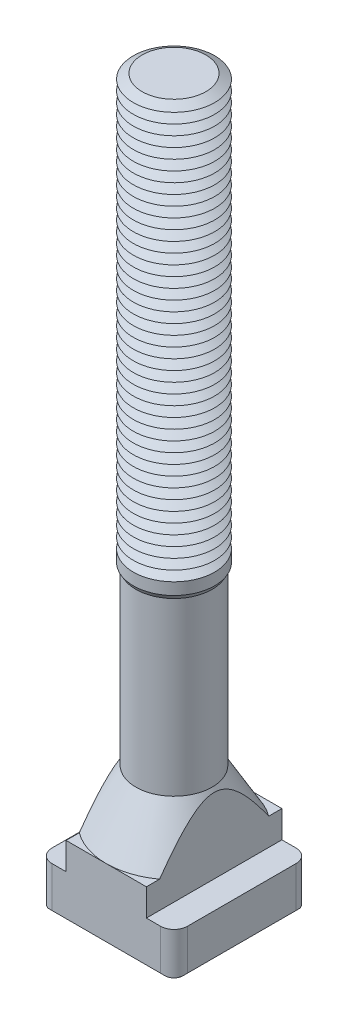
ISO-10303-21;
HEADER;
FILE_DESCRIPTION(('STEP AP214'),'2;1');
FILE_NAME('part.step','',(''),(''),'','','');
FILE_SCHEMA(('AUTOMOTIVE_DESIGN { 1 0 10303 214 1 1 1 1 }'));
ENDSEC;
DATA;
#1=APPLICATION_CONTEXT('core data for automotive mechanical design processes');
#2=APPLICATION_PROTOCOL_DEFINITION('international standard','automotive_design',2000,#1);
#3=PRODUCT_CONTEXT('',#1,'mechanical');
#4=PRODUCT('Part','Part','',(#3));
#5=PRODUCT_RELATED_PRODUCT_CATEGORY('part','',(#4));
#6=PRODUCT_DEFINITION_FORMATION('','',#4);
#7=PRODUCT_DEFINITION_CONTEXT('part definition',#1,'design');
#8=PRODUCT_DEFINITION('design','',#6,#7);
#9=PRODUCT_DEFINITION_SHAPE('','',#8);
#10=(LENGTH_UNIT() NAMED_UNIT(*) SI_UNIT(.MILLI.,.METRE.));
#11=(NAMED_UNIT(*) PLANE_ANGLE_UNIT() SI_UNIT($,.RADIAN.));
#12=(NAMED_UNIT(*) SI_UNIT($,.STERADIAN.) SOLID_ANGLE_UNIT());
#13=UNCERTAINTY_MEASURE_WITH_UNIT(LENGTH_MEASURE(1.E-05),#10,'distance_accuracy_value','');
#14=(GEOMETRIC_REPRESENTATION_CONTEXT(3) GLOBAL_UNCERTAINTY_ASSIGNED_CONTEXT((#13)) GLOBAL_UNIT_ASSIGNED_CONTEXT((#10,
#11,#12)) REPRESENTATION_CONTEXT('',''));
#15=CARTESIAN_POINT('',(0.,0.,0.));
#16=DIRECTION('',(0.,0.,1.));
#17=DIRECTION('',(1.,0.,0.));
#18=AXIS2_PLACEMENT_3D('',#15,#16,#17);
#19=CARTESIAN_POINT('',(0.,204.,0.));
#20=DIRECTION('',(0.,-1.,0.));
#21=DIRECTION('',(0.,0.,-1.));
#22=AXIS2_PLACEMENT_3D('',#19,#20,#21);
#23=CONICAL_SURFACE('',#22,9.4019237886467,1.0471975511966);
#24=CARTESIAN_POINT('',(0.,202.5,0.));
#25=DIRECTION('',(0.,-1.,0.));
#26=DIRECTION('',(0.,0.,-1.));
#27=AXIS2_PLACEMENT_3D('',#24,#25,#26);
#28=CIRCLE('',#27,12.);
#29=CARTESIAN_POINT('',(0.,202.5,-12.));
#30=VERTEX_POINT('',#29);
#31=EDGE_CURVE('E817',#30,#30,#28,.T.);
#32=ORIENTED_EDGE('',*,*,#31,.F.);
#33=EDGE_LOOP('',(#32));
#34=FACE_BOUND('',#33,.T.);
#35=CARTESIAN_POINT('',(0.,204.,0.));
#36=DIRECTION('',(0.,-1.,0.));
#37=DIRECTION('',(0.,0.,-1.));
#38=AXIS2_PLACEMENT_3D('',#35,#36,#37);
#39=CIRCLE('',#38,9.4019237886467);
#40=CARTESIAN_POINT('',(0.,204.,-9.4019237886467));
#41=VERTEX_POINT('',#40);
#42=EDGE_CURVE('E659',#41,#41,#39,.T.);
#43=ORIENTED_EDGE('',*,*,#42,.T.);
#44=EDGE_LOOP('',(#43));
#45=FACE_BOUND('',#44,.T.);
#46=ADVANCED_FACE('F39',(#34,#45),#23,.T.);
#47=CARTESIAN_POINT('',(0.,205.5,0.));
#48=DIRECTION('',(0.,1.,0.));
#49=DIRECTION('',(0.,0.,1.));
#50=AXIS2_PLACEMENT_3D('',#47,#48,#49);
#51=CONICAL_SURFACE('',#50,12.,1.0471975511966);
#52=ORIENTED_EDGE('',*,*,#42,.F.);
#53=EDGE_LOOP('',(#52));
#54=FACE_BOUND('',#53,.T.);
#55=CARTESIAN_POINT('',(0.,205.5,0.));
#56=DIRECTION('',(0.,-1.,0.));
#57=DIRECTION('',(0.,0.,-1.));
#58=AXIS2_PLACEMENT_3D('',#55,#56,#57);
#59=CIRCLE('',#58,12.);
#60=CARTESIAN_POINT('',(0.,205.5,-12.));
#61=VERTEX_POINT('',#60);
#62=EDGE_CURVE('E655',#61,#61,#59,.T.);
#63=ORIENTED_EDGE('',*,*,#62,.T.);
#64=EDGE_LOOP('',(#63));
#65=FACE_BOUND('',#64,.T.);
#66=ADVANCED_FACE('F449',(#54,#65),#51,.T.);
#67=CARTESIAN_POINT('',(5.45399514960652,216.,0.));
#68=DIRECTION('',(0.,-1.,0.));
#69=DIRECTION('',(1.,0.,0.));
#70=AXIS2_PLACEMENT_3D('',#67,#68,#69);
#71=PLANE('',#70);
#72=CARTESIAN_POINT('',(0.,216.,0.));
#73=DIRECTION('',(0.,-1.,0.));
#74=DIRECTION('',(0.,0.,-1.));
#75=AXIS2_PLACEMENT_3D('',#72,#73,#74);
#76=CIRCLE('',#75,9.4019237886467);
#77=CARTESIAN_POINT('',(0.,216.,-9.4019237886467));
#78=VERTEX_POINT('',#77);
#79=EDGE_CURVE('E846',#78,#78,#76,.T.);
#80=ORIENTED_EDGE('',*,*,#79,.F.);
#81=EDGE_LOOP('',(#80));
#82=FACE_BOUND('',#81,.T.);
#83=ADVANCED_FACE('F455',(#82),#71,.F.);
#84=CARTESIAN_POINT('',(0.,216.,0.));
#85=DIRECTION('',(0.,-1.,0.));
#86=DIRECTION('',(0.,0.,-1.));
#87=AXIS2_PLACEMENT_3D('',#84,#85,#86);
#88=CONICAL_SURFACE('',#87,9.4019237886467,1.0471975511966);
#89=CARTESIAN_POINT('',(0.,214.5,0.));
#90=DIRECTION('',(0.,-1.,0.));
#91=DIRECTION('',(0.,0.,-1.));
#92=AXIS2_PLACEMENT_3D('',#89,#90,#91);
#93=CIRCLE('',#92,12.);
#94=CARTESIAN_POINT('',(0.,214.5,-12.));
#95=VERTEX_POINT('',#94);
#96=EDGE_CURVE('E842',#95,#95,#93,.T.);
#97=ORIENTED_EDGE('',*,*,#96,.F.);
#98=EDGE_LOOP('',(#97));
#99=FACE_BOUND('',#98,.T.);
#100=ORIENTED_EDGE('',*,*,#79,.T.);
#101=EDGE_LOOP('',(#100));
#102=FACE_BOUND('',#101,.T.);
#103=ADVANCED_FACE('F483',(#99,#102),#88,.T.);
#104=CARTESIAN_POINT('',(0.,214.5,0.));
#105=DIRECTION('',(0.,1.,0.));
#106=DIRECTION('',(0.,0.,1.));
#107=AXIS2_PLACEMENT_3D('',#104,#105,#106);
#108=CONICAL_SURFACE('',#107,12.,1.0471975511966);
#109=CARTESIAN_POINT('',(0.,213.,0.));
#110=DIRECTION('',(0.,-1.,0.));
#111=DIRECTION('',(0.,0.,-1.));
#112=AXIS2_PLACEMENT_3D('',#109,#110,#111);
#113=CIRCLE('',#112,9.4019237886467);
#114=CARTESIAN_POINT('',(0.,213.,-9.4019237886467));
#115=VERTEX_POINT('',#114);
#116=EDGE_CURVE('E838',#115,#115,#113,.T.);
#117=ORIENTED_EDGE('',*,*,#116,.F.);
#118=EDGE_LOOP('',(#117));
#119=FACE_BOUND('',#118,.T.);
#120=ORIENTED_EDGE('',*,*,#96,.T.);
#121=EDGE_LOOP('',(#120));
#122=FACE_BOUND('',#121,.T.);
#123=ADVANCED_FACE('F480',(#119,#122),#108,.T.);
#124=CARTESIAN_POINT('',(0.,213.,0.));
#125=DIRECTION('',(0.,-1.,0.));
#126=DIRECTION('',(0.,0.,-1.));
#127=AXIS2_PLACEMENT_3D('',#124,#125,#126);
#128=CONICAL_SURFACE('',#127,9.4019237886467,1.0471975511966);
#129=CARTESIAN_POINT('',(0.,211.5,0.));
#130=DIRECTION('',(0.,-1.,0.));
#131=DIRECTION('',(0.,0.,-1.));
#132=AXIS2_PLACEMENT_3D('',#129,#130,#131);
#133=CIRCLE('',#132,12.);
#134=CARTESIAN_POINT('',(0.,211.5,-12.));
#135=VERTEX_POINT('',#134);
#136=EDGE_CURVE('E834',#135,#135,#133,.T.);
#137=ORIENTED_EDGE('',*,*,#136,.F.);
#138=EDGE_LOOP('',(#137));
#139=FACE_BOUND('',#138,.T.);
#140=ORIENTED_EDGE('',*,*,#116,.T.);
#141=EDGE_LOOP('',(#140));
#142=FACE_BOUND('',#141,.T.);
#143=ADVANCED_FACE('F475',(#139,#142),#128,.T.);
#144=CARTESIAN_POINT('',(0.,211.5,0.));
#145=DIRECTION('',(0.,1.,0.));
#146=DIRECTION('',(0.,0.,1.));
#147=AXIS2_PLACEMENT_3D('',#144,#145,#146);
#148=CONICAL_SURFACE('',#147,12.,1.0471975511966);
#149=CARTESIAN_POINT('',(0.,210.,0.));
#150=DIRECTION('',(0.,-1.,0.));
#151=DIRECTION('',(0.,0.,-1.));
#152=AXIS2_PLACEMENT_3D('',#149,#150,#151);
#153=CIRCLE('',#152,9.4019237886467);
#154=CARTESIAN_POINT('',(0.,210.,-9.4019237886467));
#155=VERTEX_POINT('',#154);
#156=EDGE_CURVE('E830',#155,#155,#153,.T.);
#157=ORIENTED_EDGE('',*,*,#156,.F.);
#158=EDGE_LOOP('',(#157));
#159=FACE_BOUND('',#158,.T.);
#160=ORIENTED_EDGE('',*,*,#136,.T.);
#161=EDGE_LOOP('',(#160));
#162=FACE_BOUND('',#161,.T.);
#163=ADVANCED_FACE('F472',(#159,#162),#148,.T.);
#164=CARTESIAN_POINT('',(0.,210.,0.));
#165=DIRECTION('',(0.,-1.,0.));
#166=DIRECTION('',(0.,0.,-1.));
#167=AXIS2_PLACEMENT_3D('',#164,#165,#166);
#168=CONICAL_SURFACE('',#167,9.4019237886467,1.0471975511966);
#169=CARTESIAN_POINT('',(0.,208.5,0.));
#170=DIRECTION('',(0.,-1.,0.));
#171=DIRECTION('',(0.,0.,-1.));
#172=AXIS2_PLACEMENT_3D('',#169,#170,#171);
#173=CIRCLE('',#172,12.);
#174=CARTESIAN_POINT('',(0.,208.5,-12.));
#175=VERTEX_POINT('',#174);
#176=EDGE_CURVE('E826',#175,#175,#173,.T.);
#177=ORIENTED_EDGE('',*,*,#176,.F.);
#178=EDGE_LOOP('',(#177));
#179=FACE_BOUND('',#178,.T.);
#180=ORIENTED_EDGE('',*,*,#156,.T.);
#181=EDGE_LOOP('',(#180));
#182=FACE_BOUND('',#181,.T.);
#183=ADVANCED_FACE('F466',(#179,#182),#168,.T.);
#184=CARTESIAN_POINT('',(0.,208.5,0.));
#185=DIRECTION('',(0.,1.,0.));
#186=DIRECTION('',(0.,0.,1.));
#187=AXIS2_PLACEMENT_3D('',#184,#185,#186);
#188=CONICAL_SURFACE('',#187,12.,1.0471975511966);
#189=CARTESIAN_POINT('',(0.,207.,0.));
#190=DIRECTION('',(0.,-1.,0.));
#191=DIRECTION('',(0.,0.,-1.));
#192=AXIS2_PLACEMENT_3D('',#189,#190,#191);
#193=CIRCLE('',#192,9.4019237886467);
#194=CARTESIAN_POINT('',(0.,207.,-9.4019237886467));
#195=VERTEX_POINT('',#194);
#196=EDGE_CURVE('E658',#195,#195,#193,.T.);
#197=ORIENTED_EDGE('',*,*,#196,.F.);
#198=EDGE_LOOP('',(#197));
#199=FACE_BOUND('',#198,.T.);
#200=ORIENTED_EDGE('',*,*,#176,.T.);
#201=EDGE_LOOP('',(#200));
#202=FACE_BOUND('',#201,.T.);
#203=ADVANCED_FACE('F462',(#199,#202),#188,.T.);
#204=CARTESIAN_POINT('',(0.,207.,0.));
#205=DIRECTION('',(0.,-1.,0.));
#206=DIRECTION('',(0.,0.,-1.));
#207=AXIS2_PLACEMENT_3D('',#204,#205,#206);
#208=CONICAL_SURFACE('',#207,9.4019237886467,1.0471975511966);
#209=ORIENTED_EDGE('',*,*,#62,.F.);
#210=EDGE_LOOP('',(#209));
#211=FACE_BOUND('',#210,.T.);
#212=ORIENTED_EDGE('',*,*,#196,.T.);
#213=EDGE_LOOP('',(#212));
#214=FACE_BOUND('',#213,.T.);
#215=ADVANCED_FACE('F465',(#211,#214),#208,.T.);
#216=CARTESIAN_POINT('',(0.,201.,0.));
#217=DIRECTION('',(0.,-1.,0.));
#218=DIRECTION('',(0.,0.,-1.));
#219=AXIS2_PLACEMENT_3D('',#216,#217,#218);
#220=CONICAL_SURFACE('',#219,9.4019237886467,1.0471975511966);
#221=CARTESIAN_POINT('',(0.,199.5,0.));
#222=DIRECTION('',(0.,-1.,0.));
#223=DIRECTION('',(0.,0.,-1.));
#224=AXIS2_PLACEMENT_3D('',#221,#222,#223);
#225=CIRCLE('',#224,12.);
#226=CARTESIAN_POINT('',(0.,199.5,-12.));
#227=VERTEX_POINT('',#226);
#228=EDGE_CURVE('E809',#227,#227,#225,.T.);
#229=ORIENTED_EDGE('',*,*,#228,.F.);
#230=EDGE_LOOP('',(#229));
#231=FACE_BOUND('',#230,.T.);
#232=CARTESIAN_POINT('',(0.,201.,0.));
#233=DIRECTION('',(0.,-1.,0.));
#234=DIRECTION('',(0.,0.,-1.));
#235=AXIS2_PLACEMENT_3D('',#232,#233,#234);
#236=CIRCLE('',#235,9.4019237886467);
#237=CARTESIAN_POINT('',(0.,201.,-9.4019237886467));
#238=VERTEX_POINT('',#237);
#239=EDGE_CURVE('E813',#238,#238,#236,.T.);
#240=ORIENTED_EDGE('',*,*,#239,.T.);
#241=EDGE_LOOP('',(#240));
#242=FACE_BOUND('',#241,.T.);
#243=ADVANCED_FACE('F470',(#231,#242),#220,.T.);
#244=CARTESIAN_POINT('',(0.,202.5,0.));
#245=DIRECTION('',(0.,1.,0.));
#246=DIRECTION('',(0.,0.,1.));
#247=AXIS2_PLACEMENT_3D('',#244,#245,#246);
#248=CONICAL_SURFACE('',#247,12.,1.0471975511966);
#249=ORIENTED_EDGE('',*,*,#239,.F.);
#250=EDGE_LOOP('',(#249));
#251=FACE_BOUND('',#250,.T.);
#252=ORIENTED_EDGE('',*,*,#31,.T.);
#253=EDGE_LOOP('',(#252));
#254=FACE_BOUND('',#253,.T.);
#255=ADVANCED_FACE('F1159',(#251,#254),#248,.T.);
#256=CARTESIAN_POINT('',(0.,198.,0.));
#257=DIRECTION('',(0.,-1.,0.));
#258=DIRECTION('',(0.,0.,-1.));
#259=AXIS2_PLACEMENT_3D('',#256,#257,#258);
#260=CONICAL_SURFACE('',#259,9.4019237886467,1.0471975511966);
#261=CARTESIAN_POINT('',(0.,196.5,0.));
#262=DIRECTION('',(0.,-1.,0.));
#263=DIRECTION('',(0.,0.,-1.));
#264=AXIS2_PLACEMENT_3D('',#261,#262,#263);
#265=CIRCLE('',#264,12.);
#266=CARTESIAN_POINT('',(0.,196.5,-12.));
#267=VERTEX_POINT('',#266);
#268=EDGE_CURVE('E801',#267,#267,#265,.T.);
#269=ORIENTED_EDGE('',*,*,#268,.F.);
#270=EDGE_LOOP('',(#269));
#271=FACE_BOUND('',#270,.T.);
#272=CARTESIAN_POINT('',(0.,198.,0.));
#273=DIRECTION('',(0.,-1.,0.));
#274=DIRECTION('',(0.,0.,-1.));
#275=AXIS2_PLACEMENT_3D('',#272,#273,#274);
#276=CIRCLE('',#275,9.4019237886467);
#277=CARTESIAN_POINT('',(0.,198.,-9.4019237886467));
#278=VERTEX_POINT('',#277);
#279=EDGE_CURVE('E805',#278,#278,#276,.T.);
#280=ORIENTED_EDGE('',*,*,#279,.T.);
#281=EDGE_LOOP('',(#280));
#282=FACE_BOUND('',#281,.T.);
#283=ADVANCED_FACE('F1155',(#271,#282),#260,.T.);
#284=CARTESIAN_POINT('',(0.,199.5,0.));
#285=DIRECTION('',(0.,1.,0.));
#286=DIRECTION('',(0.,0.,1.));
#287=AXIS2_PLACEMENT_3D('',#284,#285,#286);
#288=CONICAL_SURFACE('',#287,12.,1.0471975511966);
#289=ORIENTED_EDGE('',*,*,#279,.F.);
#290=EDGE_LOOP('',(#289));
#291=FACE_BOUND('',#290,.T.);
#292=ORIENTED_EDGE('',*,*,#228,.T.);
#293=EDGE_LOOP('',(#292));
#294=FACE_BOUND('',#293,.T.);
#295=ADVANCED_FACE('F1151',(#291,#294),#288,.T.);
#296=CARTESIAN_POINT('',(0.,195.,0.));
#297=DIRECTION('',(0.,-1.,0.));
#298=DIRECTION('',(0.,0.,-1.));
#299=AXIS2_PLACEMENT_3D('',#296,#297,#298);
#300=CONICAL_SURFACE('',#299,9.4019237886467,1.0471975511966);
#301=CARTESIAN_POINT('',(0.,193.5,0.));
#302=DIRECTION('',(0.,-1.,0.));
#303=DIRECTION('',(0.,0.,-1.));
#304=AXIS2_PLACEMENT_3D('',#301,#302,#303);
#305=CIRCLE('',#304,12.);
#306=CARTESIAN_POINT('',(0.,193.5,-12.));
#307=VERTEX_POINT('',#306);
#308=EDGE_CURVE('E634',#307,#307,#305,.T.);
#309=ORIENTED_EDGE('',*,*,#308,.F.);
#310=EDGE_LOOP('',(#309));
#311=FACE_BOUND('',#310,.T.);
#312=CARTESIAN_POINT('',(0.,195.,0.));
#313=DIRECTION('',(0.,-1.,0.));
#314=DIRECTION('',(0.,0.,-1.));
#315=AXIS2_PLACEMENT_3D('',#312,#313,#314);
#316=CIRCLE('',#315,9.4019237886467);
#317=CARTESIAN_POINT('',(0.,195.,-9.4019237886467));
#318=VERTEX_POINT('',#317);
#319=EDGE_CURVE('E797',#318,#318,#316,.T.);
#320=ORIENTED_EDGE('',*,*,#319,.T.);
#321=EDGE_LOOP('',(#320));
#322=FACE_BOUND('',#321,.T.);
#323=ADVANCED_FACE('F1147',(#311,#322),#300,.T.);
#324=CARTESIAN_POINT('',(0.,196.5,0.));
#325=DIRECTION('',(0.,1.,0.));
#326=DIRECTION('',(0.,0.,1.));
#327=AXIS2_PLACEMENT_3D('',#324,#325,#326);
#328=CONICAL_SURFACE('',#327,12.,1.0471975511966);
#329=ORIENTED_EDGE('',*,*,#319,.F.);
#330=EDGE_LOOP('',(#329));
#331=FACE_BOUND('',#330,.T.);
#332=ORIENTED_EDGE('',*,*,#268,.T.);
#333=EDGE_LOOP('',(#332));
#334=FACE_BOUND('',#333,.T.);
#335=ADVANCED_FACE('F1143',(#331,#334),#328,.T.);
#336=CARTESIAN_POINT('',(0.,192.,0.));
#337=DIRECTION('',(0.,-1.,0.));
#338=DIRECTION('',(0.,0.,-1.));
#339=AXIS2_PLACEMENT_3D('',#336,#337,#338);
#340=CONICAL_SURFACE('',#339,9.4019237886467,1.0471975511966);
#341=CARTESIAN_POINT('',(0.,190.5,0.));
#342=DIRECTION('',(0.,-1.,0.));
#343=DIRECTION('',(0.,0.,-1.));
#344=AXIS2_PLACEMENT_3D('',#341,#342,#343);
#345=CIRCLE('',#344,12.);
#346=CARTESIAN_POINT('',(0.,190.5,-12.));
#347=VERTEX_POINT('',#346);
#348=EDGE_CURVE('E635',#347,#347,#345,.T.);
#349=ORIENTED_EDGE('',*,*,#348,.F.);
#350=EDGE_LOOP('',(#349));
#351=FACE_BOUND('',#350,.T.);
#352=CARTESIAN_POINT('',(0.,192.,0.));
#353=DIRECTION('',(0.,-1.,0.));
#354=DIRECTION('',(0.,0.,-1.));
#355=AXIS2_PLACEMENT_3D('',#352,#353,#354);
#356=CIRCLE('',#355,9.4019237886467);
#357=CARTESIAN_POINT('',(0.,192.,-9.4019237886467));
#358=VERTEX_POINT('',#357);
#359=EDGE_CURVE('E631',#358,#358,#356,.T.);
#360=ORIENTED_EDGE('',*,*,#359,.T.);
#361=EDGE_LOOP('',(#360));
#362=FACE_BOUND('',#361,.T.);
#363=ADVANCED_FACE('F1139',(#351,#362),#340,.T.);
#364=CARTESIAN_POINT('',(0.,193.5,0.));
#365=DIRECTION('',(0.,1.,0.));
#366=DIRECTION('',(0.,0.,1.));
#367=AXIS2_PLACEMENT_3D('',#364,#365,#366);
#368=CONICAL_SURFACE('',#367,12.,1.0471975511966);
#369=ORIENTED_EDGE('',*,*,#359,.F.);
#370=EDGE_LOOP('',(#369));
#371=FACE_BOUND('',#370,.T.);
#372=ORIENTED_EDGE('',*,*,#308,.T.);
#373=EDGE_LOOP('',(#372));
#374=FACE_BOUND('',#373,.T.);
#375=ADVANCED_FACE('F1135',(#371,#374),#368,.T.);
#376=CARTESIAN_POINT('',(0.,189.,0.));
#377=DIRECTION('',(0.,-1.,0.));
#378=DIRECTION('',(0.,0.,-1.));
#379=AXIS2_PLACEMENT_3D('',#376,#377,#378);
#380=CONICAL_SURFACE('',#379,9.4019237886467,1.0471975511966);
#381=CARTESIAN_POINT('',(0.,187.5,0.));
#382=DIRECTION('',(0.,-1.,0.));
#383=DIRECTION('',(0.,0.,-1.));
#384=AXIS2_PLACEMENT_3D('',#381,#382,#383);
#385=CIRCLE('',#384,12.);
#386=CARTESIAN_POINT('',(0.,187.5,-12.));
#387=VERTEX_POINT('',#386);
#388=EDGE_CURVE('E664',#387,#387,#385,.T.);
#389=ORIENTED_EDGE('',*,*,#388,.F.);
#390=EDGE_LOOP('',(#389));
#391=FACE_BOUND('',#390,.T.);
#392=CARTESIAN_POINT('',(0.,189.,0.));
#393=DIRECTION('',(0.,-1.,0.));
#394=DIRECTION('',(0.,0.,-1.));
#395=AXIS2_PLACEMENT_3D('',#392,#393,#394);
#396=CIRCLE('',#395,9.4019237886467);
#397=CARTESIAN_POINT('',(0.,189.,-9.4019237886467));
#398=VERTEX_POINT('',#397);
#399=EDGE_CURVE('E787',#398,#398,#396,.T.);
#400=ORIENTED_EDGE('',*,*,#399,.T.);
#401=EDGE_LOOP('',(#400));
#402=FACE_BOUND('',#401,.T.);
#403=ADVANCED_FACE('F1131',(#391,#402),#380,.T.);
#404=CARTESIAN_POINT('',(0.,190.5,0.));
#405=DIRECTION('',(0.,1.,0.));
#406=DIRECTION('',(0.,0.,1.));
#407=AXIS2_PLACEMENT_3D('',#404,#405,#406);
#408=CONICAL_SURFACE('',#407,12.,1.0471975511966);
#409=ORIENTED_EDGE('',*,*,#399,.F.);
#410=EDGE_LOOP('',(#409));
#411=FACE_BOUND('',#410,.T.);
#412=ORIENTED_EDGE('',*,*,#348,.T.);
#413=EDGE_LOOP('',(#412));
#414=FACE_BOUND('',#413,.T.);
#415=ADVANCED_FACE('F1127',(#411,#414),#408,.T.);
#416=CARTESIAN_POINT('',(0.,186.,0.));
#417=DIRECTION('',(0.,-1.,0.));
#418=DIRECTION('',(0.,0.,-1.));
#419=AXIS2_PLACEMENT_3D('',#416,#417,#418);
#420=CONICAL_SURFACE('',#419,9.4019237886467,1.0471975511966);
#421=CARTESIAN_POINT('',(0.,184.5,0.));
#422=DIRECTION('',(0.,-1.,0.));
#423=DIRECTION('',(0.,0.,-1.));
#424=AXIS2_PLACEMENT_3D('',#421,#422,#423);
#425=CIRCLE('',#424,12.);
#426=CARTESIAN_POINT('',(0.,184.5,-12.));
#427=VERTEX_POINT('',#426);
#428=EDGE_CURVE('E640',#427,#427,#425,.T.);
#429=ORIENTED_EDGE('',*,*,#428,.F.);
#430=EDGE_LOOP('',(#429));
#431=FACE_BOUND('',#430,.T.);
#432=CARTESIAN_POINT('',(0.,186.,0.));
#433=DIRECTION('',(0.,-1.,0.));
#434=DIRECTION('',(0.,0.,-1.));
#435=AXIS2_PLACEMENT_3D('',#432,#433,#434);
#436=CIRCLE('',#435,9.4019237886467);
#437=CARTESIAN_POINT('',(0.,186.,-9.4019237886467));
#438=VERTEX_POINT('',#437);
#439=EDGE_CURVE('E661',#438,#438,#436,.T.);
#440=ORIENTED_EDGE('',*,*,#439,.T.);
#441=EDGE_LOOP('',(#440));
#442=FACE_BOUND('',#441,.T.);
#443=ADVANCED_FACE('F1123',(#431,#442),#420,.T.);
#444=CARTESIAN_POINT('',(0.,187.5,0.));
#445=DIRECTION('',(0.,1.,0.));
#446=DIRECTION('',(0.,0.,1.));
#447=AXIS2_PLACEMENT_3D('',#444,#445,#446);
#448=CONICAL_SURFACE('',#447,12.,1.0471975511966);
#449=ORIENTED_EDGE('',*,*,#439,.F.);
#450=EDGE_LOOP('',(#449));
#451=FACE_BOUND('',#450,.T.);
#452=ORIENTED_EDGE('',*,*,#388,.T.);
#453=EDGE_LOOP('',(#452));
#454=FACE_BOUND('',#453,.T.);
#455=ADVANCED_FACE('F1119',(#451,#454),#448,.T.);
#456=CARTESIAN_POINT('',(0.,183.,0.));
#457=DIRECTION('',(0.,-1.,0.));
#458=DIRECTION('',(0.,0.,-1.));
#459=AXIS2_PLACEMENT_3D('',#456,#457,#458);
#460=CONICAL_SURFACE('',#459,9.4019237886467,1.0471975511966);
#461=CARTESIAN_POINT('',(0.,181.5,0.));
#462=DIRECTION('',(0.,-1.,0.));
#463=DIRECTION('',(0.,0.,-1.));
#464=AXIS2_PLACEMENT_3D('',#461,#462,#463);
#465=CIRCLE('',#464,12.);
#466=CARTESIAN_POINT('',(0.,181.5,-12.));
#467=VERTEX_POINT('',#466);
#468=EDGE_CURVE('E641',#467,#467,#465,.T.);
#469=ORIENTED_EDGE('',*,*,#468,.F.);
#470=EDGE_LOOP('',(#469));
#471=FACE_BOUND('',#470,.T.);
#472=CARTESIAN_POINT('',(0.,183.,0.));
#473=DIRECTION('',(0.,-1.,0.));
#474=DIRECTION('',(0.,0.,-1.));
#475=AXIS2_PLACEMENT_3D('',#472,#473,#474);
#476=CIRCLE('',#475,9.4019237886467);
#477=CARTESIAN_POINT('',(0.,183.,-9.4019237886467));
#478=VERTEX_POINT('',#477);
#479=EDGE_CURVE('E637',#478,#478,#476,.T.);
#480=ORIENTED_EDGE('',*,*,#479,.T.);
#481=EDGE_LOOP('',(#480));
#482=FACE_BOUND('',#481,.T.);
#483=ADVANCED_FACE('F1115',(#471,#482),#460,.T.);
#484=CARTESIAN_POINT('',(0.,184.5,0.));
#485=DIRECTION('',(0.,1.,0.));
#486=DIRECTION('',(0.,0.,1.));
#487=AXIS2_PLACEMENT_3D('',#484,#485,#486);
#488=CONICAL_SURFACE('',#487,12.,1.0471975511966);
#489=ORIENTED_EDGE('',*,*,#479,.F.);
#490=EDGE_LOOP('',(#489));
#491=FACE_BOUND('',#490,.T.);
#492=ORIENTED_EDGE('',*,*,#428,.T.);
#493=EDGE_LOOP('',(#492));
#494=FACE_BOUND('',#493,.T.);
#495=ADVANCED_FACE('F1111',(#491,#494),#488,.T.);
#496=CARTESIAN_POINT('',(0.,180.,0.));
#497=DIRECTION('',(0.,-1.,0.));
#498=DIRECTION('',(0.,0.,-1.));
#499=AXIS2_PLACEMENT_3D('',#496,#497,#498);
#500=CONICAL_SURFACE('',#499,9.4019237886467,1.0471975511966);
#501=CARTESIAN_POINT('',(0.,178.5,0.));
#502=DIRECTION('',(0.,-1.,0.));
#503=DIRECTION('',(0.,0.,-1.));
#504=AXIS2_PLACEMENT_3D('',#501,#502,#503);
#505=CIRCLE('',#504,12.);
#506=CARTESIAN_POINT('',(0.,178.5,-12.));
#507=VERTEX_POINT('',#506);
#508=EDGE_CURVE('E666',#507,#507,#505,.T.);
#509=ORIENTED_EDGE('',*,*,#508,.F.);
#510=EDGE_LOOP('',(#509));
#511=FACE_BOUND('',#510,.T.);
#512=CARTESIAN_POINT('',(0.,180.,0.));
#513=DIRECTION('',(0.,-1.,0.));
#514=DIRECTION('',(0.,0.,-1.));
#515=AXIS2_PLACEMENT_3D('',#512,#513,#514);
#516=CIRCLE('',#515,9.4019237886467);
#517=CARTESIAN_POINT('',(0.,180.,-9.4019237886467));
#518=VERTEX_POINT('',#517);
#519=EDGE_CURVE('E669',#518,#518,#516,.T.);
#520=ORIENTED_EDGE('',*,*,#519,.T.);
#521=EDGE_LOOP('',(#520));
#522=FACE_BOUND('',#521,.T.);
#523=ADVANCED_FACE('F1107',(#511,#522),#500,.T.);
#524=CARTESIAN_POINT('',(0.,181.5,0.));
#525=DIRECTION('',(0.,1.,0.));
#526=DIRECTION('',(0.,0.,1.));
#527=AXIS2_PLACEMENT_3D('',#524,#525,#526);
#528=CONICAL_SURFACE('',#527,12.,1.0471975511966);
#529=ORIENTED_EDGE('',*,*,#519,.F.);
#530=EDGE_LOOP('',(#529));
#531=FACE_BOUND('',#530,.T.);
#532=ORIENTED_EDGE('',*,*,#468,.T.);
#533=EDGE_LOOP('',(#532));
#534=FACE_BOUND('',#533,.T.);
#535=ADVANCED_FACE('F1103',(#531,#534),#528,.T.);
#536=CARTESIAN_POINT('',(0.,177.,0.));
#537=DIRECTION('',(0.,-1.,0.));
#538=DIRECTION('',(0.,0.,-1.));
#539=AXIS2_PLACEMENT_3D('',#536,#537,#538);
#540=CONICAL_SURFACE('',#539,9.4019237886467,1.0471975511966);
#541=CARTESIAN_POINT('',(0.,175.5,0.));
#542=DIRECTION('',(0.,-1.,0.));
#543=DIRECTION('',(0.,0.,-1.));
#544=AXIS2_PLACEMENT_3D('',#541,#542,#543);
#545=CIRCLE('',#544,12.);
#546=CARTESIAN_POINT('',(0.,175.5,-12.));
#547=VERTEX_POINT('',#546);
#548=EDGE_CURVE('E768',#547,#547,#545,.T.);
#549=ORIENTED_EDGE('',*,*,#548,.F.);
#550=EDGE_LOOP('',(#549));
#551=FACE_BOUND('',#550,.T.);
#552=CARTESIAN_POINT('',(0.,177.,0.));
#553=DIRECTION('',(0.,-1.,0.));
#554=DIRECTION('',(0.,0.,-1.));
#555=AXIS2_PLACEMENT_3D('',#552,#553,#554);
#556=CIRCLE('',#555,9.4019237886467);
#557=CARTESIAN_POINT('',(0.,177.,-9.4019237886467));
#558=VERTEX_POINT('',#557);
#559=EDGE_CURVE('E670',#558,#558,#556,.T.);
#560=ORIENTED_EDGE('',*,*,#559,.T.);
#561=EDGE_LOOP('',(#560));
#562=FACE_BOUND('',#561,.T.);
#563=ADVANCED_FACE('F1099',(#551,#562),#540,.T.);
#564=CARTESIAN_POINT('',(0.,178.5,0.));
#565=DIRECTION('',(0.,1.,0.));
#566=DIRECTION('',(0.,0.,1.));
#567=AXIS2_PLACEMENT_3D('',#564,#565,#566);
#568=CONICAL_SURFACE('',#567,12.,1.0471975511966);
#569=ORIENTED_EDGE('',*,*,#559,.F.);
#570=EDGE_LOOP('',(#569));
#571=FACE_BOUND('',#570,.T.);
#572=ORIENTED_EDGE('',*,*,#508,.T.);
#573=EDGE_LOOP('',(#572));
#574=FACE_BOUND('',#573,.T.);
#575=ADVANCED_FACE('F1095',(#571,#574),#568,.T.);
#576=CARTESIAN_POINT('',(0.,174.,0.));
#577=DIRECTION('',(0.,-1.,0.));
#578=DIRECTION('',(0.,0.,-1.));
#579=AXIS2_PLACEMENT_3D('',#576,#577,#578);
#580=CONICAL_SURFACE('',#579,9.4019237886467,1.0471975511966);
#581=CARTESIAN_POINT('',(0.,172.5,0.));
#582=DIRECTION('',(0.,-1.,0.));
#583=DIRECTION('',(0.,0.,-1.));
#584=AXIS2_PLACEMENT_3D('',#581,#582,#583);
#585=CIRCLE('',#584,12.);
#586=CARTESIAN_POINT('',(0.,172.5,-12.));
#587=VERTEX_POINT('',#586);
#588=EDGE_CURVE('E760',#587,#587,#585,.T.);
#589=ORIENTED_EDGE('',*,*,#588,.F.);
#590=EDGE_LOOP('',(#589));
#591=FACE_BOUND('',#590,.T.);
#592=CARTESIAN_POINT('',(0.,174.,0.));
#593=DIRECTION('',(0.,-1.,0.));
#594=DIRECTION('',(0.,0.,-1.));
#595=AXIS2_PLACEMENT_3D('',#592,#593,#594);
#596=CIRCLE('',#595,9.4019237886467);
#597=CARTESIAN_POINT('',(0.,174.,-9.4019237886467));
#598=VERTEX_POINT('',#597);
#599=EDGE_CURVE('E764',#598,#598,#596,.T.);
#600=ORIENTED_EDGE('',*,*,#599,.T.);
#601=EDGE_LOOP('',(#600));
#602=FACE_BOUND('',#601,.T.);
#603=ADVANCED_FACE('F1091',(#591,#602),#580,.T.);
#604=CARTESIAN_POINT('',(0.,175.5,0.));
#605=DIRECTION('',(0.,1.,0.));
#606=DIRECTION('',(0.,0.,1.));
#607=AXIS2_PLACEMENT_3D('',#604,#605,#606);
#608=CONICAL_SURFACE('',#607,12.,1.0471975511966);
#609=ORIENTED_EDGE('',*,*,#599,.F.);
#610=EDGE_LOOP('',(#609));
#611=FACE_BOUND('',#610,.T.);
#612=ORIENTED_EDGE('',*,*,#548,.T.);
#613=EDGE_LOOP('',(#612));
#614=FACE_BOUND('',#613,.T.);
#615=ADVANCED_FACE('F1087',(#611,#614),#608,.T.);
#616=CARTESIAN_POINT('',(0.,171.,0.));
#617=DIRECTION('',(0.,-1.,0.));
#618=DIRECTION('',(0.,0.,-1.));
#619=AXIS2_PLACEMENT_3D('',#616,#617,#618);
#620=CONICAL_SURFACE('',#619,9.4019237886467,1.0471975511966);
#621=CARTESIAN_POINT('',(0.,169.5,0.));
#622=DIRECTION('',(0.,-1.,0.));
#623=DIRECTION('',(0.,0.,-1.));
#624=AXIS2_PLACEMENT_3D('',#621,#622,#623);
#625=CIRCLE('',#624,12.);
#626=CARTESIAN_POINT('',(0.,169.5,-12.));
#627=VERTEX_POINT('',#626);
#628=EDGE_CURVE('E752',#627,#627,#625,.T.);
#629=ORIENTED_EDGE('',*,*,#628,.F.);
#630=EDGE_LOOP('',(#629));
#631=FACE_BOUND('',#630,.T.);
#632=CARTESIAN_POINT('',(0.,171.,0.));
#633=DIRECTION('',(0.,-1.,0.));
#634=DIRECTION('',(0.,0.,-1.));
#635=AXIS2_PLACEMENT_3D('',#632,#633,#634);
#636=CIRCLE('',#635,9.4019237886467);
#637=CARTESIAN_POINT('',(0.,171.,-9.4019237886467));
#638=VERTEX_POINT('',#637);
#639=EDGE_CURVE('E756',#638,#638,#636,.T.);
#640=ORIENTED_EDGE('',*,*,#639,.T.);
#641=EDGE_LOOP('',(#640));
#642=FACE_BOUND('',#641,.T.);
#643=ADVANCED_FACE('F1083',(#631,#642),#620,.T.);
#644=CARTESIAN_POINT('',(0.,172.5,0.));
#645=DIRECTION('',(0.,1.,0.));
#646=DIRECTION('',(0.,0.,1.));
#647=AXIS2_PLACEMENT_3D('',#644,#645,#646);
#648=CONICAL_SURFACE('',#647,12.,1.0471975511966);
#649=ORIENTED_EDGE('',*,*,#639,.F.);
#650=EDGE_LOOP('',(#649));
#651=FACE_BOUND('',#650,.T.);
#652=ORIENTED_EDGE('',*,*,#588,.T.);
#653=EDGE_LOOP('',(#652));
#654=FACE_BOUND('',#653,.T.);
#655=ADVANCED_FACE('F1079',(#651,#654),#648,.T.);
#656=CARTESIAN_POINT('',(0.,168.,0.));
#657=DIRECTION('',(0.,-1.,0.));
#658=DIRECTION('',(0.,0.,-1.));
#659=AXIS2_PLACEMENT_3D('',#656,#657,#658);
#660=CONICAL_SURFACE('',#659,9.4019237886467,1.0471975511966);
#661=CARTESIAN_POINT('',(0.,166.5,0.));
#662=DIRECTION('',(0.,-1.,0.));
#663=DIRECTION('',(0.,0.,-1.));
#664=AXIS2_PLACEMENT_3D('',#661,#662,#663);
#665=CIRCLE('',#664,12.);
#666=CARTESIAN_POINT('',(0.,166.5,-12.));
#667=VERTEX_POINT('',#666);
#668=EDGE_CURVE('E744',#667,#667,#665,.T.);
#669=ORIENTED_EDGE('',*,*,#668,.F.);
#670=EDGE_LOOP('',(#669));
#671=FACE_BOUND('',#670,.T.);
#672=CARTESIAN_POINT('',(0.,168.,0.));
#673=DIRECTION('',(0.,-1.,0.));
#674=DIRECTION('',(0.,0.,-1.));
#675=AXIS2_PLACEMENT_3D('',#672,#673,#674);
#676=CIRCLE('',#675,9.4019237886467);
#677=CARTESIAN_POINT('',(0.,168.,-9.4019237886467));
#678=VERTEX_POINT('',#677);
#679=EDGE_CURVE('E748',#678,#678,#676,.T.);
#680=ORIENTED_EDGE('',*,*,#679,.T.);
#681=EDGE_LOOP('',(#680));
#682=FACE_BOUND('',#681,.T.);
#683=ADVANCED_FACE('F1075',(#671,#682),#660,.T.);
#684=CARTESIAN_POINT('',(0.,169.5,0.));
#685=DIRECTION('',(0.,1.,0.));
#686=DIRECTION('',(0.,0.,1.));
#687=AXIS2_PLACEMENT_3D('',#684,#685,#686);
#688=CONICAL_SURFACE('',#687,12.,1.0471975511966);
#689=ORIENTED_EDGE('',*,*,#679,.F.);
#690=EDGE_LOOP('',(#689));
#691=FACE_BOUND('',#690,.T.);
#692=ORIENTED_EDGE('',*,*,#628,.T.);
#693=EDGE_LOOP('',(#692));
#694=FACE_BOUND('',#693,.T.);
#695=ADVANCED_FACE('F1071',(#691,#694),#688,.T.);
#696=CARTESIAN_POINT('',(0.,165.,0.));
#697=DIRECTION('',(0.,-1.,0.));
#698=DIRECTION('',(0.,0.,-1.));
#699=AXIS2_PLACEMENT_3D('',#696,#697,#698);
#700=CONICAL_SURFACE('',#699,9.4019237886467,1.0471975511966);
#701=CARTESIAN_POINT('',(0.,163.5,0.));
#702=DIRECTION('',(0.,-1.,0.));
#703=DIRECTION('',(0.,0.,-1.));
#704=AXIS2_PLACEMENT_3D('',#701,#702,#703);
#705=CIRCLE('',#704,12.);
#706=CARTESIAN_POINT('',(0.,163.5,-12.));
#707=VERTEX_POINT('',#706);
#708=EDGE_CURVE('E736',#707,#707,#705,.T.);
#709=ORIENTED_EDGE('',*,*,#708,.F.);
#710=EDGE_LOOP('',(#709));
#711=FACE_BOUND('',#710,.T.);
#712=CARTESIAN_POINT('',(0.,165.,0.));
#713=DIRECTION('',(0.,-1.,0.));
#714=DIRECTION('',(0.,0.,-1.));
#715=AXIS2_PLACEMENT_3D('',#712,#713,#714);
#716=CIRCLE('',#715,9.4019237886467);
#717=CARTESIAN_POINT('',(0.,165.,-9.4019237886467));
#718=VERTEX_POINT('',#717);
#719=EDGE_CURVE('E740',#718,#718,#716,.T.);
#720=ORIENTED_EDGE('',*,*,#719,.T.);
#721=EDGE_LOOP('',(#720));
#722=FACE_BOUND('',#721,.T.);
#723=ADVANCED_FACE('F1067',(#711,#722),#700,.T.);
#724=CARTESIAN_POINT('',(0.,166.5,0.));
#725=DIRECTION('',(0.,1.,0.));
#726=DIRECTION('',(0.,0.,1.));
#727=AXIS2_PLACEMENT_3D('',#724,#725,#726);
#728=CONICAL_SURFACE('',#727,12.,1.0471975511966);
#729=ORIENTED_EDGE('',*,*,#719,.F.);
#730=EDGE_LOOP('',(#729));
#731=FACE_BOUND('',#730,.T.);
#732=ORIENTED_EDGE('',*,*,#668,.T.);
#733=EDGE_LOOP('',(#732));
#734=FACE_BOUND('',#733,.T.);
#735=ADVANCED_FACE('F1063',(#731,#734),#728,.T.);
#736=CARTESIAN_POINT('',(0.,162.,0.));
#737=DIRECTION('',(0.,-1.,0.));
#738=DIRECTION('',(0.,0.,-1.));
#739=AXIS2_PLACEMENT_3D('',#736,#737,#738);
#740=CONICAL_SURFACE('',#739,9.4019237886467,1.0471975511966);
#741=CARTESIAN_POINT('',(0.,160.5,0.));
#742=DIRECTION('',(0.,-1.,0.));
#743=DIRECTION('',(0.,0.,-1.));
#744=AXIS2_PLACEMENT_3D('',#741,#742,#743);
#745=CIRCLE('',#744,12.);
#746=CARTESIAN_POINT('',(0.,160.5,-12.));
#747=VERTEX_POINT('',#746);
#748=EDGE_CURVE('E728',#747,#747,#745,.T.);
#749=ORIENTED_EDGE('',*,*,#748,.F.);
#750=EDGE_LOOP('',(#749));
#751=FACE_BOUND('',#750,.T.);
#752=CARTESIAN_POINT('',(0.,162.,0.));
#753=DIRECTION('',(0.,-1.,0.));
#754=DIRECTION('',(0.,0.,-1.));
#755=AXIS2_PLACEMENT_3D('',#752,#753,#754);
#756=CIRCLE('',#755,9.4019237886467);
#757=CARTESIAN_POINT('',(0.,162.,-9.4019237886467));
#758=VERTEX_POINT('',#757);
#759=EDGE_CURVE('E732',#758,#758,#756,.T.);
#760=ORIENTED_EDGE('',*,*,#759,.T.);
#761=EDGE_LOOP('',(#760));
#762=FACE_BOUND('',#761,.T.);
#763=ADVANCED_FACE('F1059',(#751,#762),#740,.T.);
#764=CARTESIAN_POINT('',(0.,163.5,0.));
#765=DIRECTION('',(0.,1.,0.));
#766=DIRECTION('',(0.,0.,1.));
#767=AXIS2_PLACEMENT_3D('',#764,#765,#766);
#768=CONICAL_SURFACE('',#767,12.,1.0471975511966);
#769=ORIENTED_EDGE('',*,*,#759,.F.);
#770=EDGE_LOOP('',(#769));
#771=FACE_BOUND('',#770,.T.);
#772=ORIENTED_EDGE('',*,*,#708,.T.);
#773=EDGE_LOOP('',(#772));
#774=FACE_BOUND('',#773,.T.);
#775=ADVANCED_FACE('F1055',(#771,#774),#768,.T.);
#776=CARTESIAN_POINT('',(0.,159.,0.));
#777=DIRECTION('',(0.,-1.,0.));
#778=DIRECTION('',(0.,0.,-1.));
#779=AXIS2_PLACEMENT_3D('',#776,#777,#778);
#780=CONICAL_SURFACE('',#779,9.4019237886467,1.0471975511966);
#781=CARTESIAN_POINT('',(0.,157.5,0.));
#782=DIRECTION('',(0.,-1.,0.));
#783=DIRECTION('',(0.,0.,-1.));
#784=AXIS2_PLACEMENT_3D('',#781,#782,#783);
#785=CIRCLE('',#784,12.);
#786=CARTESIAN_POINT('',(0.,157.5,-12.));
#787=VERTEX_POINT('',#786);
#788=EDGE_CURVE('E720',#787,#787,#785,.T.);
#789=ORIENTED_EDGE('',*,*,#788,.F.);
#790=EDGE_LOOP('',(#789));
#791=FACE_BOUND('',#790,.T.);
#792=CARTESIAN_POINT('',(0.,159.,0.));
#793=DIRECTION('',(0.,-1.,0.));
#794=DIRECTION('',(0.,0.,-1.));
#795=AXIS2_PLACEMENT_3D('',#792,#793,#794);
#796=CIRCLE('',#795,9.4019237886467);
#797=CARTESIAN_POINT('',(0.,159.,-9.4019237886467));
#798=VERTEX_POINT('',#797);
#799=EDGE_CURVE('E724',#798,#798,#796,.T.);
#800=ORIENTED_EDGE('',*,*,#799,.T.);
#801=EDGE_LOOP('',(#800));
#802=FACE_BOUND('',#801,.T.);
#803=ADVANCED_FACE('F1051',(#791,#802),#780,.T.);
#804=CARTESIAN_POINT('',(0.,160.5,0.));
#805=DIRECTION('',(0.,1.,0.));
#806=DIRECTION('',(0.,0.,1.));
#807=AXIS2_PLACEMENT_3D('',#804,#805,#806);
#808=CONICAL_SURFACE('',#807,12.,1.0471975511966);
#809=ORIENTED_EDGE('',*,*,#799,.F.);
#810=EDGE_LOOP('',(#809));
#811=FACE_BOUND('',#810,.T.);
#812=ORIENTED_EDGE('',*,*,#748,.T.);
#813=EDGE_LOOP('',(#812));
#814=FACE_BOUND('',#813,.T.);
#815=ADVANCED_FACE('F1047',(#811,#814),#808,.T.);
#816=CARTESIAN_POINT('',(0.,156.,0.));
#817=DIRECTION('',(0.,-1.,0.));
#818=DIRECTION('',(0.,0.,-1.));
#819=AXIS2_PLACEMENT_3D('',#816,#817,#818);
#820=CONICAL_SURFACE('',#819,9.4019237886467,1.0471975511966);
#821=CARTESIAN_POINT('',(0.,154.5,0.));
#822=DIRECTION('',(0.,-1.,0.));
#823=DIRECTION('',(0.,0.,-1.));
#824=AXIS2_PLACEMENT_3D('',#821,#822,#823);
#825=CIRCLE('',#824,12.);
#826=CARTESIAN_POINT('',(0.,154.5,-12.));
#827=VERTEX_POINT('',#826);
#828=EDGE_CURVE('E712',#827,#827,#825,.T.);
#829=ORIENTED_EDGE('',*,*,#828,.F.);
#830=EDGE_LOOP('',(#829));
#831=FACE_BOUND('',#830,.T.);
#832=CARTESIAN_POINT('',(0.,156.,0.));
#833=DIRECTION('',(0.,-1.,0.));
#834=DIRECTION('',(0.,0.,-1.));
#835=AXIS2_PLACEMENT_3D('',#832,#833,#834);
#836=CIRCLE('',#835,9.4019237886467);
#837=CARTESIAN_POINT('',(0.,156.,-9.4019237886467));
#838=VERTEX_POINT('',#837);
#839=EDGE_CURVE('E716',#838,#838,#836,.T.);
#840=ORIENTED_EDGE('',*,*,#839,.T.);
#841=EDGE_LOOP('',(#840));
#842=FACE_BOUND('',#841,.T.);
#843=ADVANCED_FACE('F1043',(#831,#842),#820,.T.);
#844=CARTESIAN_POINT('',(0.,157.5,0.));
#845=DIRECTION('',(0.,1.,0.));
#846=DIRECTION('',(0.,0.,1.));
#847=AXIS2_PLACEMENT_3D('',#844,#845,#846);
#848=CONICAL_SURFACE('',#847,12.,1.0471975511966);
#849=ORIENTED_EDGE('',*,*,#839,.F.);
#850=EDGE_LOOP('',(#849));
#851=FACE_BOUND('',#850,.T.);
#852=ORIENTED_EDGE('',*,*,#788,.T.);
#853=EDGE_LOOP('',(#852));
#854=FACE_BOUND('',#853,.T.);
#855=ADVANCED_FACE('F1039',(#851,#854),#848,.T.);
#856=CARTESIAN_POINT('',(0.,153.,0.));
#857=DIRECTION('',(0.,-1.,0.));
#858=DIRECTION('',(0.,0.,-1.));
#859=AXIS2_PLACEMENT_3D('',#856,#857,#858);
#860=CONICAL_SURFACE('',#859,9.4019237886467,1.0471975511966);
#861=CARTESIAN_POINT('',(0.,151.5,0.));
#862=DIRECTION('',(0.,-1.,0.));
#863=DIRECTION('',(0.,0.,-1.));
#864=AXIS2_PLACEMENT_3D('',#861,#862,#863);
#865=CIRCLE('',#864,12.);
#866=CARTESIAN_POINT('',(0.,151.5,-12.));
#867=VERTEX_POINT('',#866);
#868=EDGE_CURVE('E704',#867,#867,#865,.T.);
#869=ORIENTED_EDGE('',*,*,#868,.F.);
#870=EDGE_LOOP('',(#869));
#871=FACE_BOUND('',#870,.T.);
#872=CARTESIAN_POINT('',(0.,153.,0.));
#873=DIRECTION('',(0.,-1.,0.));
#874=DIRECTION('',(0.,0.,-1.));
#875=AXIS2_PLACEMENT_3D('',#872,#873,#874);
#876=CIRCLE('',#875,9.4019237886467);
#877=CARTESIAN_POINT('',(0.,153.,-9.4019237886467));
#878=VERTEX_POINT('',#877);
#879=EDGE_CURVE('E708',#878,#878,#876,.T.);
#880=ORIENTED_EDGE('',*,*,#879,.T.);
#881=EDGE_LOOP('',(#880));
#882=FACE_BOUND('',#881,.T.);
#883=ADVANCED_FACE('F1035',(#871,#882),#860,.T.);
#884=CARTESIAN_POINT('',(0.,154.5,0.));
#885=DIRECTION('',(0.,1.,0.));
#886=DIRECTION('',(0.,0.,1.));
#887=AXIS2_PLACEMENT_3D('',#884,#885,#886);
#888=CONICAL_SURFACE('',#887,12.,1.0471975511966);
#889=ORIENTED_EDGE('',*,*,#879,.F.);
#890=EDGE_LOOP('',(#889));
#891=FACE_BOUND('',#890,.T.);
#892=ORIENTED_EDGE('',*,*,#828,.T.);
#893=EDGE_LOOP('',(#892));
#894=FACE_BOUND('',#893,.T.);
#895=ADVANCED_FACE('F1031',(#891,#894),#888,.T.);
#896=CARTESIAN_POINT('',(0.,150.,0.));
#897=DIRECTION('',(0.,-1.,0.));
#898=DIRECTION('',(0.,0.,-1.));
#899=AXIS2_PLACEMENT_3D('',#896,#897,#898);
#900=CONICAL_SURFACE('',#899,9.4019237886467,1.0471975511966);
#901=CARTESIAN_POINT('',(0.,148.5,0.));
#902=DIRECTION('',(0.,-1.,0.));
#903=DIRECTION('',(0.,0.,-1.));
#904=AXIS2_PLACEMENT_3D('',#901,#902,#903);
#905=CIRCLE('',#904,12.);
#906=CARTESIAN_POINT('',(0.,148.5,-12.));
#907=VERTEX_POINT('',#906);
#908=EDGE_CURVE('E696',#907,#907,#905,.T.);
#909=ORIENTED_EDGE('',*,*,#908,.F.);
#910=EDGE_LOOP('',(#909));
#911=FACE_BOUND('',#910,.T.);
#912=CARTESIAN_POINT('',(0.,150.,0.));
#913=DIRECTION('',(0.,-1.,0.));
#914=DIRECTION('',(0.,0.,-1.));
#915=AXIS2_PLACEMENT_3D('',#912,#913,#914);
#916=CIRCLE('',#915,9.4019237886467);
#917=CARTESIAN_POINT('',(0.,150.,-9.4019237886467));
#918=VERTEX_POINT('',#917);
#919=EDGE_CURVE('E700',#918,#918,#916,.T.);
#920=ORIENTED_EDGE('',*,*,#919,.T.);
#921=EDGE_LOOP('',(#920));
#922=FACE_BOUND('',#921,.T.);
#923=ADVANCED_FACE('F1027',(#911,#922),#900,.T.);
#924=CARTESIAN_POINT('',(0.,151.5,0.));
#925=DIRECTION('',(0.,1.,0.));
#926=DIRECTION('',(0.,0.,1.));
#927=AXIS2_PLACEMENT_3D('',#924,#925,#926);
#928=CONICAL_SURFACE('',#927,12.,1.0471975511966);
#929=ORIENTED_EDGE('',*,*,#919,.F.);
#930=EDGE_LOOP('',(#929));
#931=FACE_BOUND('',#930,.T.);
#932=ORIENTED_EDGE('',*,*,#868,.T.);
#933=EDGE_LOOP('',(#932));
#934=FACE_BOUND('',#933,.T.);
#935=ADVANCED_FACE('F1023',(#931,#934),#928,.T.);
#936=CARTESIAN_POINT('',(0.,147.,0.));
#937=DIRECTION('',(0.,-1.,0.));
#938=DIRECTION('',(0.,0.,-1.));
#939=AXIS2_PLACEMENT_3D('',#936,#937,#938);
#940=CONICAL_SURFACE('',#939,9.4019237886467,1.0471975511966);
#941=CARTESIAN_POINT('',(0.,145.5,0.));
#942=DIRECTION('',(0.,-1.,0.));
#943=DIRECTION('',(0.,0.,-1.));
#944=AXIS2_PLACEMENT_3D('',#941,#942,#943);
#945=CIRCLE('',#944,12.);
#946=CARTESIAN_POINT('',(0.,145.5,-12.));
#947=VERTEX_POINT('',#946);
#948=EDGE_CURVE('E681',#947,#947,#945,.T.);
#949=ORIENTED_EDGE('',*,*,#948,.F.);
#950=EDGE_LOOP('',(#949));
#951=FACE_BOUND('',#950,.T.);
#952=CARTESIAN_POINT('',(0.,147.,0.));
#953=DIRECTION('',(0.,-1.,0.));
#954=DIRECTION('',(0.,0.,-1.));
#955=AXIS2_PLACEMENT_3D('',#952,#953,#954);
#956=CIRCLE('',#955,9.4019237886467);
#957=CARTESIAN_POINT('',(0.,147.,-9.4019237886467));
#958=VERTEX_POINT('',#957);
#959=EDGE_CURVE('E692',#958,#958,#956,.T.);
#960=ORIENTED_EDGE('',*,*,#959,.T.);
#961=EDGE_LOOP('',(#960));
#962=FACE_BOUND('',#961,.T.);
#963=ADVANCED_FACE('F1019',(#951,#962),#940,.T.);
#964=CARTESIAN_POINT('',(0.,148.5,0.));
#965=DIRECTION('',(0.,1.,0.));
#966=DIRECTION('',(0.,0.,1.));
#967=AXIS2_PLACEMENT_3D('',#964,#965,#966);
#968=CONICAL_SURFACE('',#967,12.,1.0471975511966);
#969=ORIENTED_EDGE('',*,*,#959,.F.);
#970=EDGE_LOOP('',(#969));
#971=FACE_BOUND('',#970,.T.);
#972=ORIENTED_EDGE('',*,*,#908,.T.);
#973=EDGE_LOOP('',(#972));
#974=FACE_BOUND('',#973,.T.);
#975=ADVANCED_FACE('F1015',(#971,#974),#968,.T.);
#976=CARTESIAN_POINT('',(0.,144.,0.));
#977=DIRECTION('',(0.,-1.,0.));
#978=DIRECTION('',(0.,0.,-1.));
#979=AXIS2_PLACEMENT_3D('',#976,#977,#978);
#980=CONICAL_SURFACE('',#979,9.4019237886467,1.0471975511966);
#981=CARTESIAN_POINT('',(0.,142.5,0.));
#982=DIRECTION('',(0.,-1.,0.));
#983=DIRECTION('',(0.,0.,-1.));
#984=AXIS2_PLACEMENT_3D('',#981,#982,#983);
#985=CIRCLE('',#984,12.);
#986=CARTESIAN_POINT('',(0.,142.5,-12.));
#987=VERTEX_POINT('',#986);
#988=EDGE_CURVE('E672',#987,#987,#985,.T.);
#989=ORIENTED_EDGE('',*,*,#988,.F.);
#990=EDGE_LOOP('',(#989));
#991=FACE_BOUND('',#990,.T.);
#992=CARTESIAN_POINT('',(0.,144.,0.));
#993=DIRECTION('',(0.,-1.,0.));
#994=DIRECTION('',(0.,0.,-1.));
#995=AXIS2_PLACEMENT_3D('',#992,#993,#994);
#996=CIRCLE('',#995,9.4019237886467);
#997=CARTESIAN_POINT('',(0.,144.,-9.4019237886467));
#998=VERTEX_POINT('',#997);
#999=EDGE_CURVE('E674',#998,#998,#996,.T.);
#1000=ORIENTED_EDGE('',*,*,#999,.T.);
#1001=EDGE_LOOP('',(#1000));
#1002=FACE_BOUND('',#1001,.T.);
#1003=ADVANCED_FACE('F1011',(#991,#1002),#980,.T.);
#1004=CARTESIAN_POINT('',(0.,145.5,0.));
#1005=DIRECTION('',(0.,1.,0.));
#1006=DIRECTION('',(0.,0.,1.));
#1007=AXIS2_PLACEMENT_3D('',#1004,#1005,#1006);
#1008=CONICAL_SURFACE('',#1007,12.,1.0471975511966);
#1009=ORIENTED_EDGE('',*,*,#999,.F.);
#1010=EDGE_LOOP('',(#1009));
#1011=FACE_BOUND('',#1010,.T.);
#1012=ORIENTED_EDGE('',*,*,#948,.T.);
#1013=EDGE_LOOP('',(#1012));
#1014=FACE_BOUND('',#1013,.T.);
#1015=ADVANCED_FACE('F1000',(#1011,#1014),#1008,.T.);
#1016=CARTESIAN_POINT('',(0.,141.,0.));
#1017=DIRECTION('',(0.,-1.,0.));
#1018=DIRECTION('',(0.,0.,-1.));
#1019=AXIS2_PLACEMENT_3D('',#1016,#1017,#1018);
#1020=CONICAL_SURFACE('',#1019,9.4019237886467,1.0471975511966);
#1021=CARTESIAN_POINT('',(0.,139.5,0.));
#1022=DIRECTION('',(0.,-1.,0.));
#1023=DIRECTION('',(0.,0.,-1.));
#1024=AXIS2_PLACEMENT_3D('',#1021,#1022,#1023);
#1025=CIRCLE('',#1024,12.);
#1026=CARTESIAN_POINT('',(0.,139.5,-12.));
#1027=VERTEX_POINT('',#1026);
#1028=EDGE_CURVE('E685',#1027,#1027,#1025,.T.);
#1029=ORIENTED_EDGE('',*,*,#1028,.F.);
#1030=EDGE_LOOP('',(#1029));
#1031=FACE_BOUND('',#1030,.T.);
#1032=CARTESIAN_POINT('',(0.,141.,0.));
#1033=DIRECTION('',(0.,-1.,0.));
#1034=DIRECTION('',(0.,0.,-1.));
#1035=AXIS2_PLACEMENT_3D('',#1032,#1033,#1034);
#1036=CIRCLE('',#1035,9.4019237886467);
#1037=CARTESIAN_POINT('',(0.,141.,-9.4019237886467));
#1038=VERTEX_POINT('',#1037);
#1039=EDGE_CURVE('E675',#1038,#1038,#1036,.T.);
#1040=ORIENTED_EDGE('',*,*,#1039,.T.);
#1041=EDGE_LOOP('',(#1040));
#1042=FACE_BOUND('',#1041,.T.);
#1043=ADVANCED_FACE('F997',(#1031,#1042),#1020,.T.);
#1044=CARTESIAN_POINT('',(0.,142.5,0.));
#1045=DIRECTION('',(0.,1.,0.));
#1046=DIRECTION('',(0.,0.,1.));
#1047=AXIS2_PLACEMENT_3D('',#1044,#1045,#1046);
#1048=CONICAL_SURFACE('',#1047,12.,1.0471975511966);
#1049=ORIENTED_EDGE('',*,*,#1039,.F.);
#1050=EDGE_LOOP('',(#1049));
#1051=FACE_BOUND('',#1050,.T.);
#1052=ORIENTED_EDGE('',*,*,#988,.T.);
#1053=EDGE_LOOP('',(#1052));
#1054=FACE_BOUND('',#1053,.T.);
#1055=ADVANCED_FACE('F987',(#1051,#1054),#1048,.T.);
#1056=CARTESIAN_POINT('',(0.,138.,0.));
#1057=DIRECTION('',(0.,-1.,0.));
#1058=DIRECTION('',(0.,0.,-1.));
#1059=AXIS2_PLACEMENT_3D('',#1056,#1057,#1058);
#1060=CONICAL_SURFACE('',#1059,9.4019237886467,1.0471975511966);
#1061=CARTESIAN_POINT('',(0.,136.5,0.));
#1062=DIRECTION('',(0.,-1.,0.));
#1063=DIRECTION('',(0.,0.,-1.));
#1064=AXIS2_PLACEMENT_3D('',#1061,#1062,#1063);
#1065=CIRCLE('',#1064,12.);
#1066=CARTESIAN_POINT('',(0.,136.5,-12.));
#1067=VERTEX_POINT('',#1066);
#1068=EDGE_CURVE('E890',#1067,#1067,#1065,.T.);
#1069=ORIENTED_EDGE('',*,*,#1068,.F.);
#1070=EDGE_LOOP('',(#1069));
#1071=FACE_BOUND('',#1070,.T.);
#1072=CARTESIAN_POINT('',(0.,138.,0.));
#1073=DIRECTION('',(0.,-1.,0.));
#1074=DIRECTION('',(0.,0.,-1.));
#1075=AXIS2_PLACEMENT_3D('',#1072,#1073,#1074);
#1076=CIRCLE('',#1075,9.4019237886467);
#1077=CARTESIAN_POINT('',(0.,138.,-9.4019237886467));
#1078=VERTEX_POINT('',#1077);
#1079=EDGE_CURVE('E888',#1078,#1078,#1076,.T.);
#1080=ORIENTED_EDGE('',*,*,#1079,.T.);
#1081=EDGE_LOOP('',(#1080));
#1082=FACE_BOUND('',#1081,.T.);
#1083=ADVANCED_FACE('F983',(#1071,#1082),#1060,.T.);
#1084=CARTESIAN_POINT('',(0.,139.5,0.));
#1085=DIRECTION('',(0.,1.,0.));
#1086=DIRECTION('',(0.,0.,1.));
#1087=AXIS2_PLACEMENT_3D('',#1084,#1085,#1086);
#1088=CONICAL_SURFACE('',#1087,12.,1.0471975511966);
#1089=ORIENTED_EDGE('',*,*,#1079,.F.);
#1090=EDGE_LOOP('',(#1089));
#1091=FACE_BOUND('',#1090,.T.);
#1092=ORIENTED_EDGE('',*,*,#1028,.T.);
#1093=EDGE_LOOP('',(#1092));
#1094=FACE_BOUND('',#1093,.T.);
#1095=ADVANCED_FACE('F986',(#1091,#1094),#1088,.T.);
#1096=CARTESIAN_POINT('',(0.,135.,0.));
#1097=DIRECTION('',(0.,-1.,0.));
#1098=DIRECTION('',(0.,0.,-1.));
#1099=AXIS2_PLACEMENT_3D('',#1096,#1097,#1098);
#1100=CONICAL_SURFACE('',#1099,9.4019237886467,1.0471975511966);
#1101=CARTESIAN_POINT('',(0.,133.5,0.));
#1102=DIRECTION('',(0.,-1.,0.));
#1103=DIRECTION('',(0.,0.,-1.));
#1104=AXIS2_PLACEMENT_3D('',#1101,#1102,#1103);
#1105=CIRCLE('',#1104,12.);
#1106=CARTESIAN_POINT('',(0.,133.5,-12.));
#1107=VERTEX_POINT('',#1106);
#1108=EDGE_CURVE('E883',#1107,#1107,#1105,.T.);
#1109=ORIENTED_EDGE('',*,*,#1108,.F.);
#1110=EDGE_LOOP('',(#1109));
#1111=FACE_BOUND('',#1110,.T.);
#1112=CARTESIAN_POINT('',(0.,135.,0.));
#1113=DIRECTION('',(0.,-1.,0.));
#1114=DIRECTION('',(0.,0.,-1.));
#1115=AXIS2_PLACEMENT_3D('',#1112,#1113,#1114);
#1116=CIRCLE('',#1115,9.4019237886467);
#1117=CARTESIAN_POINT('',(0.,135.,-9.4019237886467));
#1118=VERTEX_POINT('',#1117);
#1119=EDGE_CURVE('E886',#1118,#1118,#1116,.T.);
#1120=ORIENTED_EDGE('',*,*,#1119,.T.);
#1121=EDGE_LOOP('',(#1120));
#1122=FACE_BOUND('',#1121,.T.);
#1123=ADVANCED_FACE('F993',(#1111,#1122),#1100,.T.);
#1124=CARTESIAN_POINT('',(0.,136.5,0.));
#1125=DIRECTION('',(0.,1.,0.));
#1126=DIRECTION('',(0.,0.,1.));
#1127=AXIS2_PLACEMENT_3D('',#1124,#1125,#1126);
#1128=CONICAL_SURFACE('',#1127,12.,1.0471975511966);
#1129=ORIENTED_EDGE('',*,*,#1119,.F.);
#1130=EDGE_LOOP('',(#1129));
#1131=FACE_BOUND('',#1130,.T.);
#1132=ORIENTED_EDGE('',*,*,#1068,.T.);
#1133=EDGE_LOOP('',(#1132));
#1134=FACE_BOUND('',#1133,.T.);
#1135=ADVANCED_FACE('F981',(#1131,#1134),#1128,.T.);
#1136=CARTESIAN_POINT('',(0.,132.,0.));
#1137=DIRECTION('',(0.,-1.,0.));
#1138=DIRECTION('',(0.,0.,-1.));
#1139=AXIS2_PLACEMENT_3D('',#1136,#1137,#1138);
#1140=CONICAL_SURFACE('',#1139,9.4019237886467,1.0471975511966);
#1141=CARTESIAN_POINT('',(0.,130.5,0.));
#1142=DIRECTION('',(0.,-1.,0.));
#1143=DIRECTION('',(0.,0.,-1.));
#1144=AXIS2_PLACEMENT_3D('',#1141,#1142,#1143);
#1145=CIRCLE('',#1144,12.);
#1146=CARTESIAN_POINT('',(0.,130.5,-12.));
#1147=VERTEX_POINT('',#1146);
#1148=EDGE_CURVE('E643',#1147,#1147,#1145,.T.);
#1149=ORIENTED_EDGE('',*,*,#1148,.F.);
#1150=EDGE_LOOP('',(#1149));
#1151=FACE_BOUND('',#1150,.T.);
#1152=CARTESIAN_POINT('',(0.,132.,0.));
#1153=DIRECTION('',(0.,-1.,0.));
#1154=DIRECTION('',(0.,0.,-1.));
#1155=AXIS2_PLACEMENT_3D('',#1152,#1153,#1154);
#1156=CIRCLE('',#1155,9.4019237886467);
#1157=CARTESIAN_POINT('',(0.,132.,-9.4019237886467));
#1158=VERTEX_POINT('',#1157);
#1159=EDGE_CURVE('E646',#1158,#1158,#1156,.T.);
#1160=ORIENTED_EDGE('',*,*,#1159,.T.);
#1161=EDGE_LOOP('',(#1160));
#1162=FACE_BOUND('',#1161,.T.);
#1163=ADVANCED_FACE('F1322',(#1151,#1162),#1140,.T.);
#1164=CARTESIAN_POINT('',(0.,133.5,0.));
#1165=DIRECTION('',(0.,1.,0.));
#1166=DIRECTION('',(0.,0.,1.));
#1167=AXIS2_PLACEMENT_3D('',#1164,#1165,#1166);
#1168=CONICAL_SURFACE('',#1167,12.,1.0471975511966);
#1169=ORIENTED_EDGE('',*,*,#1159,.F.);
#1170=EDGE_LOOP('',(#1169));
#1171=FACE_BOUND('',#1170,.T.);
#1172=ORIENTED_EDGE('',*,*,#1108,.T.);
#1173=EDGE_LOOP('',(#1172));
#1174=FACE_BOUND('',#1173,.T.);
#1175=ADVANCED_FACE('F1331',(#1171,#1174),#1168,.T.);
#1176=CARTESIAN_POINT('',(0.,129.,0.));
#1177=DIRECTION('',(0.,-1.,0.));
#1178=DIRECTION('',(0.,0.,-1.));
#1179=AXIS2_PLACEMENT_3D('',#1176,#1177,#1178);
#1180=CONICAL_SURFACE('',#1179,9.4019237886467,1.0471975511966);
#1181=CARTESIAN_POINT('',(0.,127.5,0.));
#1182=DIRECTION('',(0.,-1.,0.));
#1183=DIRECTION('',(0.,0.,-1.));
#1184=AXIS2_PLACEMENT_3D('',#1181,#1182,#1183);
#1185=CIRCLE('',#1184,12.);
#1186=CARTESIAN_POINT('',(0.,127.5,-12.));
#1187=VERTEX_POINT('',#1186);
#1188=EDGE_CURVE('E907',#1187,#1187,#1185,.T.);
#1189=ORIENTED_EDGE('',*,*,#1188,.F.);
#1190=EDGE_LOOP('',(#1189));
#1191=FACE_BOUND('',#1190,.T.);
#1192=CARTESIAN_POINT('',(0.,129.,0.));
#1193=DIRECTION('',(0.,-1.,0.));
#1194=DIRECTION('',(0.,0.,-1.));
#1195=AXIS2_PLACEMENT_3D('',#1192,#1193,#1194);
#1196=CIRCLE('',#1195,9.4019237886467);
#1197=CARTESIAN_POINT('',(0.,129.,-9.4019237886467));
#1198=VERTEX_POINT('',#1197);
#1199=EDGE_CURVE('E647',#1198,#1198,#1196,.T.);
#1200=ORIENTED_EDGE('',*,*,#1199,.T.);
#1201=EDGE_LOOP('',(#1200));
#1202=FACE_BOUND('',#1201,.T.);
#1203=ADVANCED_FACE('F1340',(#1191,#1202),#1180,.T.);
#1204=CARTESIAN_POINT('',(0.,130.5,0.));
#1205=DIRECTION('',(0.,1.,0.));
#1206=DIRECTION('',(0.,0.,1.));
#1207=AXIS2_PLACEMENT_3D('',#1204,#1205,#1206);
#1208=CONICAL_SURFACE('',#1207,12.,1.0471975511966);
#1209=ORIENTED_EDGE('',*,*,#1199,.F.);
#1210=EDGE_LOOP('',(#1209));
#1211=FACE_BOUND('',#1210,.T.);
#1212=ORIENTED_EDGE('',*,*,#1148,.T.);
#1213=EDGE_LOOP('',(#1212));
#1214=FACE_BOUND('',#1213,.T.);
#1215=ADVANCED_FACE('F1349',(#1211,#1214),#1208,.T.);
#1216=CARTESIAN_POINT('',(0.,126.,0.));
#1217=DIRECTION('',(0.,-1.,0.));
#1218=DIRECTION('',(0.,0.,-1.));
#1219=AXIS2_PLACEMENT_3D('',#1216,#1217,#1218);
#1220=CONICAL_SURFACE('',#1219,9.4019237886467,1.0471975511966);
#1221=CARTESIAN_POINT('',(0.,124.5,0.));
#1222=DIRECTION('',(0.,-1.,0.));
#1223=DIRECTION('',(0.,0.,-1.));
#1224=AXIS2_PLACEMENT_3D('',#1221,#1222,#1223);
#1225=CIRCLE('',#1224,12.);
#1226=CARTESIAN_POINT('',(0.,124.5,-12.));
#1227=VERTEX_POINT('',#1226);
#1228=EDGE_CURVE('E908',#1227,#1227,#1225,.T.);
#1229=ORIENTED_EDGE('',*,*,#1228,.F.);
#1230=EDGE_LOOP('',(#1229));
#1231=FACE_BOUND('',#1230,.T.);
#1232=CARTESIAN_POINT('',(0.,126.,0.));
#1233=DIRECTION('',(0.,-1.,0.));
#1234=DIRECTION('',(0.,0.,-1.));
#1235=AXIS2_PLACEMENT_3D('',#1232,#1233,#1234);
#1236=CIRCLE('',#1235,9.4019237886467);
#1237=CARTESIAN_POINT('',(0.,126.,-9.4019237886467));
#1238=VERTEX_POINT('',#1237);
#1239=EDGE_CURVE('E905',#1238,#1238,#1236,.T.);
#1240=ORIENTED_EDGE('',*,*,#1239,.T.);
#1241=EDGE_LOOP('',(#1240));
#1242=FACE_BOUND('',#1241,.T.);
#1243=ADVANCED_FACE('F1358',(#1231,#1242),#1220,.T.);
#1244=CARTESIAN_POINT('',(0.,127.5,0.));
#1245=DIRECTION('',(0.,1.,0.));
#1246=DIRECTION('',(0.,0.,1.));
#1247=AXIS2_PLACEMENT_3D('',#1244,#1245,#1246);
#1248=CONICAL_SURFACE('',#1247,12.,1.0471975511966);
#1249=ORIENTED_EDGE('',*,*,#1239,.F.);
#1250=EDGE_LOOP('',(#1249));
#1251=FACE_BOUND('',#1250,.T.);
#1252=ORIENTED_EDGE('',*,*,#1188,.T.);
#1253=EDGE_LOOP('',(#1252));
#1254=FACE_BOUND('',#1253,.T.);
#1255=ADVANCED_FACE('F1367',(#1251,#1254),#1248,.T.);
#1256=CARTESIAN_POINT('',(0.,123.,0.));
#1257=DIRECTION('',(0.,-1.,0.));
#1258=DIRECTION('',(0.,0.,-1.));
#1259=AXIS2_PLACEMENT_3D('',#1256,#1257,#1258);
#1260=CONICAL_SURFACE('',#1259,9.4019237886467,1.0471975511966);
#1261=CARTESIAN_POINT('',(0.,121.5,0.));
#1262=DIRECTION('',(0.,-1.,0.));
#1263=DIRECTION('',(0.,0.,-1.));
#1264=AXIS2_PLACEMENT_3D('',#1261,#1262,#1263);
#1265=CIRCLE('',#1264,12.);
#1266=CARTESIAN_POINT('',(0.,121.5,-12.));
#1267=VERTEX_POINT('',#1266);
#1268=EDGE_CURVE('E902',#1267,#1267,#1265,.T.);
#1269=ORIENTED_EDGE('',*,*,#1268,.F.);
#1270=EDGE_LOOP('',(#1269));
#1271=FACE_BOUND('',#1270,.T.);
#1272=CARTESIAN_POINT('',(0.,123.,0.));
#1273=DIRECTION('',(0.,-1.,0.));
#1274=DIRECTION('',(0.,0.,-1.));
#1275=AXIS2_PLACEMENT_3D('',#1272,#1273,#1274);
#1276=CIRCLE('',#1275,9.4019237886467);
#1277=CARTESIAN_POINT('',(0.,123.,-9.4019237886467));
#1278=VERTEX_POINT('',#1277);
#1279=EDGE_CURVE('E926',#1278,#1278,#1276,.T.);
#1280=ORIENTED_EDGE('',*,*,#1279,.T.);
#1281=EDGE_LOOP('',(#1280));
#1282=FACE_BOUND('',#1281,.T.);
#1283=ADVANCED_FACE('F1376',(#1271,#1282),#1260,.T.);
#1284=CARTESIAN_POINT('',(0.,124.5,0.));
#1285=DIRECTION('',(0.,1.,0.));
#1286=DIRECTION('',(0.,0.,1.));
#1287=AXIS2_PLACEMENT_3D('',#1284,#1285,#1286);
#1288=CONICAL_SURFACE('',#1287,12.,1.0471975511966);
#1289=ORIENTED_EDGE('',*,*,#1279,.F.);
#1290=EDGE_LOOP('',(#1289));
#1291=FACE_BOUND('',#1290,.T.);
#1292=ORIENTED_EDGE('',*,*,#1228,.T.);
#1293=EDGE_LOOP('',(#1292));
#1294=FACE_BOUND('',#1293,.T.);
#1295=ADVANCED_FACE('F1385',(#1291,#1294),#1288,.T.);
#1296=CARTESIAN_POINT('',(0.,120.,0.));
#1297=DIRECTION('',(0.,-1.,0.));
#1298=DIRECTION('',(0.,0.,-1.));
#1299=AXIS2_PLACEMENT_3D('',#1296,#1297,#1298);
#1300=CONICAL_SURFACE('',#1299,9.4019237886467,1.0471975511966);
#1301=CARTESIAN_POINT('',(0.,118.5,0.));
#1302=DIRECTION('',(0.,-1.,0.));
#1303=DIRECTION('',(0.,0.,-1.));
#1304=AXIS2_PLACEMENT_3D('',#1301,#1302,#1303);
#1305=CIRCLE('',#1304,12.);
#1306=CARTESIAN_POINT('',(0.,118.5,-12.));
#1307=VERTEX_POINT('',#1306);
#1308=EDGE_CURVE('E903',#1307,#1307,#1305,.T.);
#1309=ORIENTED_EDGE('',*,*,#1308,.F.);
#1310=EDGE_LOOP('',(#1309));
#1311=FACE_BOUND('',#1310,.T.);
#1312=CARTESIAN_POINT('',(0.,120.,0.));
#1313=DIRECTION('',(0.,-1.,0.));
#1314=DIRECTION('',(0.,0.,-1.));
#1315=AXIS2_PLACEMENT_3D('',#1312,#1313,#1314);
#1316=CIRCLE('',#1315,9.4019237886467);
#1317=CARTESIAN_POINT('',(0.,120.,-9.4019237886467));
#1318=VERTEX_POINT('',#1317);
#1319=EDGE_CURVE('E899',#1318,#1318,#1316,.T.);
#1320=ORIENTED_EDGE('',*,*,#1319,.T.);
#1321=EDGE_LOOP('',(#1320));
#1322=FACE_BOUND('',#1321,.T.);
#1323=ADVANCED_FACE('F1394',(#1311,#1322),#1300,.T.);
#1324=CARTESIAN_POINT('',(0.,121.5,0.));
#1325=DIRECTION('',(0.,1.,0.));
#1326=DIRECTION('',(0.,0.,1.));
#1327=AXIS2_PLACEMENT_3D('',#1324,#1325,#1326);
#1328=CONICAL_SURFACE('',#1327,12.,1.0471975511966);
#1329=ORIENTED_EDGE('',*,*,#1319,.F.);
#1330=EDGE_LOOP('',(#1329));
#1331=FACE_BOUND('',#1330,.T.);
#1332=ORIENTED_EDGE('',*,*,#1268,.T.);
#1333=EDGE_LOOP('',(#1332));
#1334=FACE_BOUND('',#1333,.T.);
#1335=ADVANCED_FACE('F1403',(#1331,#1334),#1328,.T.);
#1336=CARTESIAN_POINT('',(0.,117.,0.));
#1337=DIRECTION('',(0.,-1.,0.));
#1338=DIRECTION('',(0.,0.,-1.));
#1339=AXIS2_PLACEMENT_3D('',#1336,#1337,#1338);
#1340=CONICAL_SURFACE('',#1339,9.4019237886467,1.0471975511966);
#1341=CARTESIAN_POINT('',(0.,115.5,0.));
#1342=DIRECTION('',(0.,-1.,0.));
#1343=DIRECTION('',(0.,0.,-1.));
#1344=AXIS2_PLACEMENT_3D('',#1341,#1342,#1343);
#1345=CIRCLE('',#1344,12.);
#1346=CARTESIAN_POINT('',(0.,115.5,-12.));
#1347=VERTEX_POINT('',#1346);
#1348=EDGE_CURVE('E874',#1347,#1347,#1345,.T.);
#1349=ORIENTED_EDGE('',*,*,#1348,.F.);
#1350=EDGE_LOOP('',(#1349));
#1351=FACE_BOUND('',#1350,.T.);
#1352=CARTESIAN_POINT('',(0.,117.,0.));
#1353=DIRECTION('',(0.,-1.,0.));
#1354=DIRECTION('',(0.,0.,-1.));
#1355=AXIS2_PLACEMENT_3D('',#1352,#1353,#1354);
#1356=CIRCLE('',#1355,9.4019237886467);
#1357=CARTESIAN_POINT('',(0.,117.,-9.4019237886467));
#1358=VERTEX_POINT('',#1357);
#1359=EDGE_CURVE('E881',#1358,#1358,#1356,.T.);
#1360=ORIENTED_EDGE('',*,*,#1359,.T.);
#1361=EDGE_LOOP('',(#1360));
#1362=FACE_BOUND('',#1361,.T.);
#1363=ADVANCED_FACE('F1412',(#1351,#1362),#1340,.T.);
#1364=CARTESIAN_POINT('',(0.,118.5,0.));
#1365=DIRECTION('',(0.,1.,0.));
#1366=DIRECTION('',(0.,0.,1.));
#1367=AXIS2_PLACEMENT_3D('',#1364,#1365,#1366);
#1368=CONICAL_SURFACE('',#1367,12.,1.0471975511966);
#1369=ORIENTED_EDGE('',*,*,#1359,.F.);
#1370=EDGE_LOOP('',(#1369));
#1371=FACE_BOUND('',#1370,.T.);
#1372=ORIENTED_EDGE('',*,*,#1308,.T.);
#1373=EDGE_LOOP('',(#1372));
#1374=FACE_BOUND('',#1373,.T.);
#1375=ADVANCED_FACE('F1421',(#1371,#1374),#1368,.T.);
#1376=CARTESIAN_POINT('',(0.,114.,0.));
#1377=DIRECTION('',(0.,-1.,0.));
#1378=DIRECTION('',(0.,0.,-1.));
#1379=AXIS2_PLACEMENT_3D('',#1376,#1377,#1378);
#1380=CONICAL_SURFACE('',#1379,9.4019237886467,1.0471975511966);
#1381=CARTESIAN_POINT('',(0.,112.5,0.));
#1382=DIRECTION('',(0.,-1.,0.));
#1383=DIRECTION('',(0.,0.,-1.));
#1384=AXIS2_PLACEMENT_3D('',#1381,#1382,#1383);
#1385=CIRCLE('',#1384,12.);
#1386=CARTESIAN_POINT('',(0.,112.5,-12.));
#1387=VERTEX_POINT('',#1386);
#1388=EDGE_CURVE('E649',#1387,#1387,#1385,.T.);
#1389=ORIENTED_EDGE('',*,*,#1388,.F.);
#1390=EDGE_LOOP('',(#1389));
#1391=FACE_BOUND('',#1390,.T.);
#1392=CARTESIAN_POINT('',(0.,114.,0.));
#1393=DIRECTION('',(0.,-1.,0.));
#1394=DIRECTION('',(0.,0.,-1.));
#1395=AXIS2_PLACEMENT_3D('',#1392,#1393,#1394);
#1396=CIRCLE('',#1395,9.4019237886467);
#1397=CARTESIAN_POINT('',(0.,114.,-9.4019237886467));
#1398=VERTEX_POINT('',#1397);
#1399=EDGE_CURVE('E651',#1398,#1398,#1396,.T.);
#1400=ORIENTED_EDGE('',*,*,#1399,.T.);
#1401=EDGE_LOOP('',(#1400));
#1402=FACE_BOUND('',#1401,.T.);
#1403=ADVANCED_FACE('F1430',(#1391,#1402),#1380,.T.);
#1404=CARTESIAN_POINT('',(0.,115.5,0.));
#1405=DIRECTION('',(0.,1.,0.));
#1406=DIRECTION('',(0.,0.,1.));
#1407=AXIS2_PLACEMENT_3D('',#1404,#1405,#1406);
#1408=CONICAL_SURFACE('',#1407,12.,1.0471975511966);
#1409=ORIENTED_EDGE('',*,*,#1399,.F.);
#1410=EDGE_LOOP('',(#1409));
#1411=FACE_BOUND('',#1410,.T.);
#1412=ORIENTED_EDGE('',*,*,#1348,.T.);
#1413=EDGE_LOOP('',(#1412));
#1414=FACE_BOUND('',#1413,.T.);
#1415=ADVANCED_FACE('F1439',(#1411,#1414),#1408,.T.);
#1416=CARTESIAN_POINT('',(0.,111.,0.));
#1417=DIRECTION('',(0.,-1.,0.));
#1418=DIRECTION('',(0.,0.,-1.));
#1419=AXIS2_PLACEMENT_3D('',#1416,#1417,#1418);
#1420=CONICAL_SURFACE('',#1419,9.4019237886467,1.0471975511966);
#1421=CARTESIAN_POINT('',(0.,109.5,0.));
#1422=DIRECTION('',(0.,-1.,0.));
#1423=DIRECTION('',(0.,0.,-1.));
#1424=AXIS2_PLACEMENT_3D('',#1421,#1422,#1423);
#1425=CIRCLE('',#1424,12.);
#1426=CARTESIAN_POINT('',(0.,109.5,-12.));
#1427=VERTEX_POINT('',#1426);
#1428=EDGE_CURVE('E862',#1427,#1427,#1425,.T.);
#1429=ORIENTED_EDGE('',*,*,#1428,.F.);
#1430=EDGE_LOOP('',(#1429));
#1431=FACE_BOUND('',#1430,.T.);
#1432=CARTESIAN_POINT('',(0.,111.,0.));
#1433=DIRECTION('',(0.,-1.,0.));
#1434=DIRECTION('',(0.,0.,-1.));
#1435=AXIS2_PLACEMENT_3D('',#1432,#1433,#1434);
#1436=CIRCLE('',#1435,9.4019237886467);
#1437=CARTESIAN_POINT('',(0.,111.,-9.4019237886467));
#1438=VERTEX_POINT('',#1437);
#1439=EDGE_CURVE('E652',#1438,#1438,#1436,.T.);
#1440=ORIENTED_EDGE('',*,*,#1439,.T.);
#1441=EDGE_LOOP('',(#1440));
#1442=FACE_BOUND('',#1441,.T.);
#1443=ADVANCED_FACE('F1448',(#1431,#1442),#1420,.T.);
#1444=CARTESIAN_POINT('',(0.,112.5,0.));
#1445=DIRECTION('',(0.,1.,0.));
#1446=DIRECTION('',(0.,0.,1.));
#1447=AXIS2_PLACEMENT_3D('',#1444,#1445,#1446);
#1448=CONICAL_SURFACE('',#1447,12.,1.0471975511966);
#1449=ORIENTED_EDGE('',*,*,#1439,.F.);
#1450=EDGE_LOOP('',(#1449));
#1451=FACE_BOUND('',#1450,.T.);
#1452=ORIENTED_EDGE('',*,*,#1388,.T.);
#1453=EDGE_LOOP('',(#1452));
#1454=FACE_BOUND('',#1453,.T.);
#1455=ADVANCED_FACE('F1457',(#1451,#1454),#1448,.T.);
#1456=CARTESIAN_POINT('',(0.,108.,0.));
#1457=DIRECTION('',(0.,-1.,0.));
#1458=DIRECTION('',(0.,0.,-1.));
#1459=AXIS2_PLACEMENT_3D('',#1456,#1457,#1458);
#1460=CONICAL_SURFACE('',#1459,9.4019237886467,1.0471975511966);
#1461=CARTESIAN_POINT('',(0.,106.5,0.));
#1462=DIRECTION('',(0.,-1.,0.));
#1463=DIRECTION('',(0.,0.,-1.));
#1464=AXIS2_PLACEMENT_3D('',#1461,#1462,#1463);
#1465=CIRCLE('',#1464,12.);
#1466=CARTESIAN_POINT('',(0.,106.5,-12.));
#1467=VERTEX_POINT('',#1466);
#1468=EDGE_CURVE('E949',#1467,#1467,#1465,.T.);
#1469=ORIENTED_EDGE('',*,*,#1468,.F.);
#1470=EDGE_LOOP('',(#1469));
#1471=FACE_BOUND('',#1470,.T.);
#1472=CARTESIAN_POINT('',(0.,108.,0.));
#1473=DIRECTION('',(0.,-1.,0.));
#1474=DIRECTION('',(0.,0.,-1.));
#1475=AXIS2_PLACEMENT_3D('',#1472,#1473,#1474);
#1476=CIRCLE('',#1475,9.4019237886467);
#1477=CARTESIAN_POINT('',(0.,108.,-9.4019237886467));
#1478=VERTEX_POINT('',#1477);
#1479=EDGE_CURVE('E864',#1478,#1478,#1476,.T.);
#1480=ORIENTED_EDGE('',*,*,#1479,.T.);
#1481=EDGE_LOOP('',(#1480));
#1482=FACE_BOUND('',#1481,.T.);
#1483=ADVANCED_FACE('F1466',(#1471,#1482),#1460,.T.);
#1484=CARTESIAN_POINT('',(0.,109.5,0.));
#1485=DIRECTION('',(0.,1.,0.));
#1486=DIRECTION('',(0.,0.,1.));
#1487=AXIS2_PLACEMENT_3D('',#1484,#1485,#1486);
#1488=CONICAL_SURFACE('',#1487,12.,1.0471975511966);
#1489=ORIENTED_EDGE('',*,*,#1479,.F.);
#1490=EDGE_LOOP('',(#1489));
#1491=FACE_BOUND('',#1490,.T.);
#1492=ORIENTED_EDGE('',*,*,#1428,.T.);
#1493=EDGE_LOOP('',(#1492));
#1494=FACE_BOUND('',#1493,.T.);
#1495=ADVANCED_FACE('F1475',(#1491,#1494),#1488,.T.);
#1496=CARTESIAN_POINT('',(0.,105.,0.));
#1497=DIRECTION('',(0.,-1.,0.));
#1498=DIRECTION('',(0.,0.,-1.));
#1499=AXIS2_PLACEMENT_3D('',#1496,#1497,#1498);
#1500=CONICAL_SURFACE('',#1499,9.4019237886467,1.0471975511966);
#1501=CARTESIAN_POINT('',(0.,103.5,0.));
#1502=DIRECTION('',(0.,-1.,0.));
#1503=DIRECTION('',(0.,0.,-1.));
#1504=AXIS2_PLACEMENT_3D('',#1501,#1502,#1503);
#1505=CIRCLE('',#1504,12.);
#1506=CARTESIAN_POINT('',(0.,103.5,-12.));
#1507=VERTEX_POINT('',#1506);
#1508=EDGE_CURVE('E870',#1507,#1507,#1505,.T.);
#1509=ORIENTED_EDGE('',*,*,#1508,.F.);
#1510=EDGE_LOOP('',(#1509));
#1511=FACE_BOUND('',#1510,.T.);
#1512=CARTESIAN_POINT('',(0.,105.,0.));
#1513=DIRECTION('',(0.,-1.,0.));
#1514=DIRECTION('',(0.,0.,-1.));
#1515=AXIS2_PLACEMENT_3D('',#1512,#1513,#1514);
#1516=CIRCLE('',#1515,9.4019237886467);
#1517=CARTESIAN_POINT('',(0.,105.,-9.4019237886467));
#1518=VERTEX_POINT('',#1517);
#1519=EDGE_CURVE('E897',#1518,#1518,#1516,.T.);
#1520=ORIENTED_EDGE('',*,*,#1519,.T.);
#1521=EDGE_LOOP('',(#1520));
#1522=FACE_BOUND('',#1521,.T.);
#1523=ADVANCED_FACE('F1484',(#1511,#1522),#1500,.T.);
#1524=CARTESIAN_POINT('',(0.,106.5,0.));
#1525=DIRECTION('',(0.,1.,0.));
#1526=DIRECTION('',(0.,0.,1.));
#1527=AXIS2_PLACEMENT_3D('',#1524,#1525,#1526);
#1528=CONICAL_SURFACE('',#1527,12.,1.0471975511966);
#1529=ORIENTED_EDGE('',*,*,#1519,.F.);
#1530=EDGE_LOOP('',(#1529));
#1531=FACE_BOUND('',#1530,.T.);
#1532=ORIENTED_EDGE('',*,*,#1468,.T.);
#1533=EDGE_LOOP('',(#1532));
#1534=FACE_BOUND('',#1533,.T.);
#1535=ADVANCED_FACE('F1493',(#1531,#1534),#1528,.T.);
#1536=CARTESIAN_POINT('',(0.,102.,0.));
#1537=DIRECTION('',(0.,-1.,0.));
#1538=DIRECTION('',(0.,0.,-1.));
#1539=AXIS2_PLACEMENT_3D('',#1536,#1537,#1538);
#1540=CONICAL_SURFACE('',#1539,9.4019237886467,1.0471975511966);
#1541=CARTESIAN_POINT('',(0.,100.5,0.));
#1542=DIRECTION('',(0.,-1.,0.));
#1543=DIRECTION('',(0.,0.,-1.));
#1544=AXIS2_PLACEMENT_3D('',#1541,#1542,#1543);
#1545=CIRCLE('',#1544,12.);
#1546=CARTESIAN_POINT('',(0.,100.5,-12.));
#1547=VERTEX_POINT('',#1546);
#1548=EDGE_CURVE('E871',#1547,#1547,#1545,.T.);
#1549=ORIENTED_EDGE('',*,*,#1548,.F.);
#1550=EDGE_LOOP('',(#1549));
#1551=FACE_BOUND('',#1550,.T.);
#1552=CARTESIAN_POINT('',(0.,102.,0.));
#1553=DIRECTION('',(0.,-1.,0.));
#1554=DIRECTION('',(0.,0.,-1.));
#1555=AXIS2_PLACEMENT_3D('',#1552,#1553,#1554);
#1556=CIRCLE('',#1555,9.4019237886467);
#1557=CARTESIAN_POINT('',(0.,102.,-9.4019237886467));
#1558=VERTEX_POINT('',#1557);
#1559=EDGE_CURVE('E867',#1558,#1558,#1556,.T.);
#1560=ORIENTED_EDGE('',*,*,#1559,.T.);
#1561=EDGE_LOOP('',(#1560));
#1562=FACE_BOUND('',#1561,.T.);
#1563=ADVANCED_FACE('F1502',(#1551,#1562),#1540,.T.);
#1564=CARTESIAN_POINT('',(0.,103.5,0.));
#1565=DIRECTION('',(0.,1.,0.));
#1566=DIRECTION('',(0.,0.,1.));
#1567=AXIS2_PLACEMENT_3D('',#1564,#1565,#1566);
#1568=CONICAL_SURFACE('',#1567,12.,1.0471975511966);
#1569=ORIENTED_EDGE('',*,*,#1559,.F.);
#1570=EDGE_LOOP('',(#1569));
#1571=FACE_BOUND('',#1570,.T.);
#1572=ORIENTED_EDGE('',*,*,#1508,.T.);
#1573=EDGE_LOOP('',(#1572));
#1574=FACE_BOUND('',#1573,.T.);
#1575=ADVANCED_FACE('F1511',(#1571,#1574),#1568,.T.);
#1576=CARTESIAN_POINT('',(0.,99.,0.));
#1577=DIRECTION('',(0.,-1.,0.));
#1578=DIRECTION('',(0.,0.,-1.));
#1579=AXIS2_PLACEMENT_3D('',#1576,#1577,#1578);
#1580=CONICAL_SURFACE('',#1579,9.4019237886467,1.0471975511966);
#1581=CARTESIAN_POINT('',(0.,97.5,0.));
#1582=DIRECTION('',(0.,-1.,0.));
#1583=DIRECTION('',(0.,0.,-1.));
#1584=AXIS2_PLACEMENT_3D('',#1581,#1582,#1583);
#1585=CIRCLE('',#1584,12.);
#1586=CARTESIAN_POINT('',(0.,97.5,-12.));
#1587=VERTEX_POINT('',#1586);
#1588=EDGE_CURVE('E918',#1587,#1587,#1585,.T.);
#1589=ORIENTED_EDGE('',*,*,#1588,.F.);
#1590=EDGE_LOOP('',(#1589));
#1591=FACE_BOUND('',#1590,.T.);
#1592=CARTESIAN_POINT('',(0.,99.,0.));
#1593=DIRECTION('',(0.,-1.,0.));
#1594=DIRECTION('',(0.,0.,-1.));
#1595=AXIS2_PLACEMENT_3D('',#1592,#1593,#1594);
#1596=CIRCLE('',#1595,9.4019237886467);
#1597=CARTESIAN_POINT('',(0.,99.,-9.4019237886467));
#1598=VERTEX_POINT('',#1597);
#1599=EDGE_CURVE('E939',#1598,#1598,#1596,.T.);
#1600=ORIENTED_EDGE('',*,*,#1599,.T.);
#1601=EDGE_LOOP('',(#1600));
#1602=FACE_BOUND('',#1601,.T.);
#1603=ADVANCED_FACE('F1520',(#1591,#1602),#1580,.T.);
#1604=CARTESIAN_POINT('',(0.,100.5,0.));
#1605=DIRECTION('',(0.,1.,0.));
#1606=DIRECTION('',(0.,0.,1.));
#1607=AXIS2_PLACEMENT_3D('',#1604,#1605,#1606);
#1608=CONICAL_SURFACE('',#1607,12.,1.0471975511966);
#1609=ORIENTED_EDGE('',*,*,#1599,.F.);
#1610=EDGE_LOOP('',(#1609));
#1611=FACE_BOUND('',#1610,.T.);
#1612=ORIENTED_EDGE('',*,*,#1548,.T.);
#1613=EDGE_LOOP('',(#1612));
#1614=FACE_BOUND('',#1613,.T.);
#1615=ADVANCED_FACE('F1529',(#1611,#1614),#1608,.T.);
#1616=CARTESIAN_POINT('',(0.,96.,0.));
#1617=DIRECTION('',(0.,-1.,0.));
#1618=DIRECTION('',(0.,0.,-1.));
#1619=AXIS2_PLACEMENT_3D('',#1616,#1617,#1618);
#1620=CONICAL_SURFACE('',#1619,9.4019237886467,1.0471975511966);
#1621=CARTESIAN_POINT('',(0.,94.5,0.));
#1622=DIRECTION('',(0.,-1.,0.));
#1623=DIRECTION('',(0.,0.,-1.));
#1624=AXIS2_PLACEMENT_3D('',#1621,#1622,#1623);
#1625=CIRCLE('',#1624,12.);
#1626=CARTESIAN_POINT('',(0.,94.5,-12.));
#1627=VERTEX_POINT('',#1626);
#1628=EDGE_CURVE('E921',#1627,#1627,#1625,.T.);
#1629=ORIENTED_EDGE('',*,*,#1628,.F.);
#1630=EDGE_LOOP('',(#1629));
#1631=FACE_BOUND('',#1630,.T.);
#1632=CARTESIAN_POINT('',(0.,96.,0.));
#1633=DIRECTION('',(0.,-1.,0.));
#1634=DIRECTION('',(0.,0.,-1.));
#1635=AXIS2_PLACEMENT_3D('',#1632,#1633,#1634);
#1636=CIRCLE('',#1635,9.4019237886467);
#1637=CARTESIAN_POINT('',(0.,96.,-9.4019237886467));
#1638=VERTEX_POINT('',#1637);
#1639=EDGE_CURVE('E922',#1638,#1638,#1636,.T.);
#1640=ORIENTED_EDGE('',*,*,#1639,.T.);
#1641=EDGE_LOOP('',(#1640));
#1642=FACE_BOUND('',#1641,.T.);
#1643=ADVANCED_FACE('F567',(#1631,#1642),#1620,.T.);
#1644=CARTESIAN_POINT('',(0.,97.5,0.));
#1645=DIRECTION('',(0.,1.,0.));
#1646=DIRECTION('',(0.,0.,1.));
#1647=AXIS2_PLACEMENT_3D('',#1644,#1645,#1646);
#1648=CONICAL_SURFACE('',#1647,12.,1.0471975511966);
#1649=ORIENTED_EDGE('',*,*,#1639,.F.);
#1650=EDGE_LOOP('',(#1649));
#1651=FACE_BOUND('',#1650,.T.);
#1652=ORIENTED_EDGE('',*,*,#1588,.T.);
#1653=EDGE_LOOP('',(#1652));
#1654=FACE_BOUND('',#1653,.T.);
#1655=ADVANCED_FACE('F562',(#1651,#1654),#1648,.T.);
#1656=CARTESIAN_POINT('',(-18.1143819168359,7.77123616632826,-18.1143819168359));
#1657=DIRECTION('',(-0.577350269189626,0.577350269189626,-0.577350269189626));
#1658=DIRECTION('',(-0.707106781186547,0.,0.707106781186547));
#1659=AXIS2_PLACEMENT_3D('',#1656,#1657,#1658);
#1660=CYLINDRICAL_SURFACE('',#1659,4.);
#1661=CARTESIAN_POINT('',(-10.3431457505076,0.,-10.3431457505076));
#1662=DIRECTION('',(0.,1.,0.));
#1663=DIRECTION('',(-0.707106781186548,0.,-0.707106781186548));
#1664=AXIS2_PLACEMENT_3D('',#1661,#1662,#1663);
#1665=ELLIPSE('',#1664,6.92820323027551,4.);
#1666=CARTESIAN_POINT('',(-16.,0.,-13.1715728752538));
#1667=VERTEX_POINT('',#1666);
#1668=CARTESIAN_POINT('',(-13.1715728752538,0.,-16.));
#1669=VERTEX_POINT('',#1668);
#1670=EDGE_CURVE('E326',#1667,#1669,#1665,.F.);
#1671=ORIENTED_EDGE('',*,*,#1670,.F.);
#1672=DIRECTION('',(0.577350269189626,-0.577350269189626,0.577350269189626));
#1673=VECTOR('',#1672,1.);
#1674=CARTESIAN_POINT('',(-7.60947570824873,-8.39052429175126,-4.78104858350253));
#1675=LINE('',#1674,#1673);
#1676=CARTESIAN_POINT('',(-19.8637033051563,3.86370330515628,-17.0352761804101));
#1677=VERTEX_POINT('',#1676);
#1678=EDGE_CURVE('E367',#1677,#1667,#1675,.T.);
#1679=ORIENTED_EDGE('',*,*,#1678,.F.);
#1680=CARTESIAN_POINT('',(-16.,5.65685424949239,-16.));
#1681=DIRECTION('',(0.325057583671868,-0.888073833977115,0.325057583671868));
#1682=DIRECTION('',(-0.627963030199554,-0.459700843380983,-0.627963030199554));
#1683=AXIS2_PLACEMENT_3D('',#1680,#1681,#1682);
#1684=ELLIPSE('',#1683,4.50413000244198,4.);
#1685=CARTESIAN_POINT('',(-17.0352761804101,3.86370330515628,-19.8637033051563));
#1686=VERTEX_POINT('',#1685);
#1687=EDGE_CURVE('E264',#1677,#1686,#1684,.T.);
#1688=ORIENTED_EDGE('',*,*,#1687,.T.);
#1689=DIRECTION('',(0.577350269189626,-0.577350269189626,0.577350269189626));
#1690=VECTOR('',#1689,1.);
#1691=CARTESIAN_POINT('',(-18.1143819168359,4.94280904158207,-20.9428090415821));
#1692=LINE('',#1691,#1690);
#1693=EDGE_CURVE('E360',#1669,#1686,#1692,.F.);
#1694=ORIENTED_EDGE('',*,*,#1693,.F.);
#1695=EDGE_LOOP('',(#1671,#1679,#1688,#1694));
#1696=FACE_BOUND('',#1695,.T.);
#1697=ADVANCED_FACE('F551',(#1696),#1660,.T.);
#1698=CARTESIAN_POINT('',(4.78104858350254,-5.56209716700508,-4.78104858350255));
#1699=DIRECTION('',(0.577350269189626,0.577350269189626,-0.577350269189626));
#1700=DIRECTION('',(-0.707106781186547,0.,-0.707106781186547));
#1701=AXIS2_PLACEMENT_3D('',#1698,#1699,#1700);
#1702=CYLINDRICAL_SURFACE('',#1701,4.);
#1703=CARTESIAN_POINT('',(10.3431457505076,0.,-10.3431457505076));
#1704=DIRECTION('',(0.,1.,0.));
#1705=DIRECTION('',(0.707106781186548,0.,-0.707106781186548));
#1706=AXIS2_PLACEMENT_3D('',#1703,#1704,#1705);
#1707=ELLIPSE('',#1706,6.92820323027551,4.);
#1708=CARTESIAN_POINT('',(13.1715728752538,0.,-16.));
#1709=VERTEX_POINT('',#1708);
#1710=CARTESIAN_POINT('',(16.,0.,-13.1715728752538));
#1711=VERTEX_POINT('',#1710);
#1712=EDGE_CURVE('E332',#1709,#1711,#1707,.F.);
#1713=ORIENTED_EDGE('',*,*,#1712,.F.);
#1714=DIRECTION('',(-0.577350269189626,-0.577350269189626,0.577350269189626));
#1715=VECTOR('',#1714,1.);
#1716=CARTESIAN_POINT('',(4.78104858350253,-8.39052429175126,-7.60947570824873));
#1717=LINE('',#1716,#1715);
#1718=CARTESIAN_POINT('',(17.0352761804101,3.86370330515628,-19.8637033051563));
#1719=VERTEX_POINT('',#1718);
#1720=EDGE_CURVE('E354',#1719,#1709,#1717,.T.);
#1721=ORIENTED_EDGE('',*,*,#1720,.F.);
#1722=CARTESIAN_POINT('',(16.,5.65685424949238,-16.));
#1723=DIRECTION('',(-0.325057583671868,-0.888073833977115,0.325057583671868));
#1724=DIRECTION('',(0.627963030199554,-0.459700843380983,-0.627963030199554));
#1725=AXIS2_PLACEMENT_3D('',#1722,#1723,#1724);
#1726=ELLIPSE('',#1725,4.50413000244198,4.);
#1727=CARTESIAN_POINT('',(19.8637033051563,3.86370330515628,-17.0352761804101));
#1728=VERTEX_POINT('',#1727);
#1729=EDGE_CURVE('E407',#1719,#1728,#1726,.T.);
#1730=ORIENTED_EDGE('',*,*,#1729,.T.);
#1731=DIRECTION('',(-0.577350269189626,-0.577350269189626,0.577350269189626));
#1732=VECTOR('',#1731,1.);
#1733=CARTESIAN_POINT('',(7.60947570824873,-8.39052429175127,-4.78104858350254));
#1734=LINE('',#1733,#1732);
#1735=EDGE_CURVE('E322',#1711,#1728,#1734,.F.);
#1736=ORIENTED_EDGE('',*,*,#1735,.F.);
#1737=EDGE_LOOP('',(#1713,#1721,#1730,#1736));
#1738=FACE_BOUND('',#1737,.T.);
#1739=ADVANCED_FACE('F547',(#1738),#1702,.T.);
#1740=CARTESIAN_POINT('',(20.,0.,-20.));
#1741=DIRECTION('',(0.,1.,0.));
#1742=DIRECTION('',(0.,0.,1.));
#1743=AXIS2_PLACEMENT_3D('',#1740,#1741,#1742);
#1744=PLANE('',#1743);
#1745=DIRECTION('',(0.,0.,1.));
#1746=VECTOR('',#1745,1.);
#1747=CARTESIAN_POINT('',(16.,0.,-20.));
#1748=LINE('',#1747,#1746);
#1749=CARTESIAN_POINT('',(16.,0.,13.1715728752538));
#1750=VERTEX_POINT('',#1749);
#1751=EDGE_CURVE('E296',#1711,#1750,#1748,.T.);
#1752=ORIENTED_EDGE('',*,*,#1751,.T.);
#1753=CARTESIAN_POINT('',(10.3431457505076,0.,10.3431457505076));
#1754=DIRECTION('',(0.,1.,0.));
#1755=DIRECTION('',(-0.707106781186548,0.,-0.707106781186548));
#1756=AXIS2_PLACEMENT_3D('',#1753,#1754,#1755);
#1757=ELLIPSE('',#1756,6.92820323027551,4.);
#1758=CARTESIAN_POINT('',(13.1715728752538,0.,16.));
#1759=VERTEX_POINT('',#1758);
#1760=EDGE_CURVE('E335',#1750,#1759,#1757,.F.);
#1761=ORIENTED_EDGE('',*,*,#1760,.T.);
#1762=DIRECTION('',(-1.,0.,0.));
#1763=VECTOR('',#1762,1.);
#1764=CARTESIAN_POINT('',(20.,0.,16.));
#1765=LINE('',#1764,#1763);
#1766=CARTESIAN_POINT('',(-13.1715728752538,0.,16.));
#1767=VERTEX_POINT('',#1766);
#1768=EDGE_CURVE('E283',#1759,#1767,#1765,.T.);
#1769=ORIENTED_EDGE('',*,*,#1768,.T.);
#1770=CARTESIAN_POINT('',(-10.3431457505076,0.,10.3431457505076));
#1771=DIRECTION('',(0.,1.,0.));
#1772=DIRECTION('',(0.707106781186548,0.,-0.707106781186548));
#1773=AXIS2_PLACEMENT_3D('',#1770,#1771,#1772);
#1774=ELLIPSE('',#1773,6.92820323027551,4.);
#1775=CARTESIAN_POINT('',(-16.,0.,13.1715728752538));
#1776=VERTEX_POINT('',#1775);
#1777=EDGE_CURVE('E329',#1767,#1776,#1774,.F.);
#1778=ORIENTED_EDGE('',*,*,#1777,.T.);
#1779=DIRECTION('',(0.,0.,-1.));
#1780=VECTOR('',#1779,1.);
#1781=CARTESIAN_POINT('',(-16.,0.,-20.));
#1782=LINE('',#1781,#1780);
#1783=EDGE_CURVE('E288',#1776,#1667,#1782,.T.);
#1784=ORIENTED_EDGE('',*,*,#1783,.T.);
#1785=ORIENTED_EDGE('',*,*,#1670,.T.);
#1786=DIRECTION('',(1.,0.,0.));
#1787=VECTOR('',#1786,1.);
#1788=CARTESIAN_POINT('',(20.,0.,-16.));
#1789=LINE('',#1788,#1787);
#1790=EDGE_CURVE('E292',#1669,#1709,#1789,.T.);
#1791=ORIENTED_EDGE('',*,*,#1790,.T.);
#1792=ORIENTED_EDGE('',*,*,#1712,.T.);
#1793=EDGE_LOOP('',(#1752,#1761,#1769,#1778,#1784,#1785,#1791,#1792));
#1794=FACE_BOUND('',#1793,.T.);
#1795=ADVANCED_FACE('F550',(#1794),#1744,.F.);
#1796=CARTESIAN_POINT('',(-18.1143819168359,7.77123616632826,18.1143819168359));
#1797=DIRECTION('',(0.577350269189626,-0.577350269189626,-0.577350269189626));
#1798=DIRECTION('',(-0.707106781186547,0.,-0.707106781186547));
#1799=AXIS2_PLACEMENT_3D('',#1796,#1797,#1798);
#1800=CYLINDRICAL_SURFACE('',#1799,4.);
#1801=CARTESIAN_POINT('',(-16.,5.65685424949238,16.));
#1802=DIRECTION('',(0.325057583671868,-0.888073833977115,-0.325057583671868));
#1803=DIRECTION('',(-0.627963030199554,-0.459700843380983,0.627963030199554));
#1804=AXIS2_PLACEMENT_3D('',#1801,#1802,#1803);
#1805=ELLIPSE('',#1804,4.50413000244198,4.);
#1806=CARTESIAN_POINT('',(-17.0352761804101,3.86370330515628,19.8637033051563));
#1807=VERTEX_POINT('',#1806);
#1808=CARTESIAN_POINT('',(-19.8637033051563,3.86370330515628,17.0352761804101));
#1809=VERTEX_POINT('',#1808);
#1810=EDGE_CURVE('E410',#1807,#1809,#1805,.T.);
#1811=ORIENTED_EDGE('',*,*,#1810,.T.);
#1812=DIRECTION('',(-0.577350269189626,0.577350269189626,0.577350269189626));
#1813=VECTOR('',#1812,1.);
#1814=CARTESIAN_POINT('',(-20.9428090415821,4.94280904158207,18.1143819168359));
#1815=LINE('',#1814,#1813);
#1816=EDGE_CURVE('E373',#1776,#1809,#1815,.T.);
#1817=ORIENTED_EDGE('',*,*,#1816,.F.);
#1818=ORIENTED_EDGE('',*,*,#1777,.F.);
#1819=DIRECTION('',(-0.577350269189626,0.577350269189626,0.577350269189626));
#1820=VECTOR('',#1819,1.);
#1821=CARTESIAN_POINT('',(-18.1143819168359,4.94280904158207,20.9428090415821));
#1822=LINE('',#1821,#1820);
#1823=EDGE_CURVE('E347',#1807,#1767,#1822,.F.);
#1824=ORIENTED_EDGE('',*,*,#1823,.F.);
#1825=EDGE_LOOP('',(#1811,#1817,#1818,#1824));
#1826=FACE_BOUND('',#1825,.T.);
#1827=ADVANCED_FACE('F542',(#1826),#1800,.T.);
#1828=CARTESIAN_POINT('',(-20.,4.,20.));
#1829=DIRECTION('',(0.707106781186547,0.707106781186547,0.));
#1830=DIRECTION('',(-0.707106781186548,0.707106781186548,0.));
#1831=AXIS2_PLACEMENT_3D('',#1828,#1829,#1830);
#1832=PLANE('',#1831);
#1833=ORIENTED_EDGE('',*,*,#1783,.F.);
#1834=ORIENTED_EDGE('',*,*,#1816,.T.);
#1835=CARTESIAN_POINT('',(-16.,0.,16.));
#1836=DIRECTION('',(0.707106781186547,0.707106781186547,0.));
#1837=DIRECTION('',(0.707106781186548,-0.707106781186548,0.));
#1838=AXIS2_PLACEMENT_3D('',#1835,#1836,#1837);
#1839=ELLIPSE('',#1838,5.65685424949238,4.);
#1840=CARTESIAN_POINT('',(-20.,4.,16.));
#1841=VERTEX_POINT('',#1840);
#1842=EDGE_CURVE('E370',#1809,#1841,#1839,.F.);
#1843=ORIENTED_EDGE('',*,*,#1842,.T.);
#1844=DIRECTION('',(0.,0.,1.));
#1845=VECTOR('',#1844,1.);
#1846=CARTESIAN_POINT('',(-20.,4.,20.));
#1847=LINE('',#1846,#1845);
#1848=CARTESIAN_POINT('',(-20.,4.,-16.));
#1849=VERTEX_POINT('',#1848);
#1850=EDGE_CURVE('E304',#1849,#1841,#1847,.T.);
#1851=ORIENTED_EDGE('',*,*,#1850,.F.);
#1852=CARTESIAN_POINT('',(-16.,0.,-16.));
#1853=DIRECTION('',(0.707106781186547,0.707106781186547,0.));
#1854=DIRECTION('',(0.707106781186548,-0.707106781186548,0.));
#1855=AXIS2_PLACEMENT_3D('',#1852,#1853,#1854);
#1856=ELLIPSE('',#1855,5.65685424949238,4.);
#1857=EDGE_CURVE('E364',#1849,#1677,#1856,.F.);
#1858=ORIENTED_EDGE('',*,*,#1857,.T.);
#1859=ORIENTED_EDGE('',*,*,#1678,.T.);
#1860=EDGE_LOOP('',(#1833,#1834,#1843,#1851,#1858,#1859));
#1861=FACE_BOUND('',#1860,.T.);
#1862=ADVANCED_FACE('F529',(#1861),#1832,.F.);
#1863=CARTESIAN_POINT('',(20.,4.,20.));
#1864=DIRECTION('',(-0.707106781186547,0.707106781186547,0.));
#1865=DIRECTION('',(-0.707106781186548,-0.707106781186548,0.));
#1866=AXIS2_PLACEMENT_3D('',#1863,#1864,#1865);
#1867=PLANE('',#1866);
#1868=ORIENTED_EDGE('',*,*,#1751,.F.);
#1869=ORIENTED_EDGE('',*,*,#1735,.T.);
#1870=CARTESIAN_POINT('',(16.,0.,-16.));
#1871=DIRECTION('',(-0.707106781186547,0.707106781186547,0.));
#1872=DIRECTION('',(-0.707106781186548,-0.707106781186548,0.));
#1873=AXIS2_PLACEMENT_3D('',#1870,#1871,#1872);
#1874=ELLIPSE('',#1873,5.65685424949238,4.);
#1875=CARTESIAN_POINT('',(20.,4.,-16.));
#1876=VERTEX_POINT('',#1875);
#1877=EDGE_CURVE('E319',#1728,#1876,#1874,.F.);
#1878=ORIENTED_EDGE('',*,*,#1877,.T.);
#1879=DIRECTION('',(0.,0.,-1.));
#1880=VECTOR('',#1879,1.);
#1881=CARTESIAN_POINT('',(20.,4.,20.));
#1882=LINE('',#1881,#1880);
#1883=CARTESIAN_POINT('',(20.,4.,16.));
#1884=VERTEX_POINT('',#1883);
#1885=EDGE_CURVE('E279',#1884,#1876,#1882,.T.);
#1886=ORIENTED_EDGE('',*,*,#1885,.F.);
#1887=CARTESIAN_POINT('',(16.,0.,16.));
#1888=DIRECTION('',(-0.707106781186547,0.707106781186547,0.));
#1889=DIRECTION('',(-0.707106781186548,-0.707106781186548,0.));
#1890=AXIS2_PLACEMENT_3D('',#1887,#1888,#1889);
#1891=ELLIPSE('',#1890,5.65685424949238,4.);
#1892=CARTESIAN_POINT('',(19.8637033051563,3.86370330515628,17.0352761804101));
#1893=VERTEX_POINT('',#1892);
#1894=EDGE_CURVE('E312',#1884,#1893,#1891,.F.);
#1895=ORIENTED_EDGE('',*,*,#1894,.T.);
#1896=DIRECTION('',(0.577350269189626,0.577350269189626,0.577350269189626));
#1897=VECTOR('',#1896,1.);
#1898=CARTESIAN_POINT('',(20.9428090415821,4.94280904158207,18.1143819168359));
#1899=LINE('',#1898,#1897);
#1900=EDGE_CURVE('E315',#1893,#1750,#1899,.F.);
#1901=ORIENTED_EDGE('',*,*,#1900,.T.);
#1902=EDGE_LOOP('',(#1868,#1869,#1878,#1886,#1895,#1901));
#1903=FACE_BOUND('',#1902,.T.);
#1904=ADVANCED_FACE('F526',(#1903),#1867,.F.);
#1905=CARTESIAN_POINT('',(18.1143819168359,7.77123616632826,18.1143819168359));
#1906=DIRECTION('',(-0.577350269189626,-0.577350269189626,-0.577350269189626));
#1907=DIRECTION('',(-0.707106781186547,0.,0.707106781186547));
#1908=AXIS2_PLACEMENT_3D('',#1905,#1906,#1907);
#1909=CYLINDRICAL_SURFACE('',#1908,4.);
#1910=CARTESIAN_POINT('',(16.,5.65685424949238,16.));
#1911=DIRECTION('',(-0.325057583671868,-0.888073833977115,-0.325057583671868));
#1912=DIRECTION('',(0.627963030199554,-0.459700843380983,0.627963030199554));
#1913=AXIS2_PLACEMENT_3D('',#1910,#1911,#1912);
#1914=ELLIPSE('',#1913,4.50413000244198,4.);
#1915=CARTESIAN_POINT('',(17.0352761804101,3.86370330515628,19.8637033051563));
#1916=VERTEX_POINT('',#1915);
#1917=EDGE_CURVE('E269',#1893,#1916,#1914,.T.);
#1918=ORIENTED_EDGE('',*,*,#1917,.T.);
#1919=DIRECTION('',(0.577350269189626,0.577350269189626,0.577350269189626));
#1920=VECTOR('',#1919,1.);
#1921=CARTESIAN_POINT('',(4.78104858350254,-8.39052429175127,7.60947570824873));
#1922=LINE('',#1921,#1920);
#1923=EDGE_CURVE('E341',#1759,#1916,#1922,.T.);
#1924=ORIENTED_EDGE('',*,*,#1923,.F.);
#1925=ORIENTED_EDGE('',*,*,#1760,.F.);
#1926=ORIENTED_EDGE('',*,*,#1900,.F.);
#1927=EDGE_LOOP('',(#1918,#1924,#1925,#1926));
#1928=FACE_BOUND('',#1927,.T.);
#1929=ADVANCED_FACE('F523',(#1928),#1909,.T.);
#1930=CARTESIAN_POINT('',(-20.,24.,20.));
#1931=DIRECTION('',(1.,0.,0.));
#1932=DIRECTION('',(0.,0.,-1.));
#1933=AXIS2_PLACEMENT_3D('',#1930,#1931,#1932);
#1934=PLANE('',#1933);
#1935=DIRECTION('',(0.,-1.,0.));
#1936=VECTOR('',#1935,1.);
#1937=CARTESIAN_POINT('',(-20.,24.,16.));
#1938=LINE('',#1937,#1936);
#1939=CARTESIAN_POINT('',(-20.,16.,16.));
#1940=VERTEX_POINT('',#1939);
#1941=EDGE_CURVE('E386',#1841,#1940,#1938,.F.);
#1942=ORIENTED_EDGE('',*,*,#1941,.T.);
#1943=DIRECTION('',(0.,0.,-1.));
#1944=VECTOR('',#1943,1.);
#1945=CARTESIAN_POINT('',(-20.,16.,20.));
#1946=LINE('',#1945,#1944);
#1947=CARTESIAN_POINT('',(-20.,16.,-16.));
#1948=VERTEX_POINT('',#1947);
#1949=EDGE_CURVE('E231',#1940,#1948,#1946,.T.);
#1950=ORIENTED_EDGE('',*,*,#1949,.T.);
#1951=DIRECTION('',(0.,-1.,0.));
#1952=VECTOR('',#1951,1.);
#1953=CARTESIAN_POINT('',(-20.,24.,-16.));
#1954=LINE('',#1953,#1952);
#1955=EDGE_CURVE('E383',#1948,#1849,#1954,.T.);
#1956=ORIENTED_EDGE('',*,*,#1955,.T.);
#1957=ORIENTED_EDGE('',*,*,#1850,.T.);
#1958=EDGE_LOOP('',(#1942,#1950,#1956,#1957));
#1959=FACE_BOUND('',#1958,.T.);
#1960=ADVANCED_FACE('F521',(#1959),#1934,.F.);
#1961=CARTESIAN_POINT('',(-16.,24.,-16.));
#1962=DIRECTION('',(0.,-1.,0.));
#1963=DIRECTION('',(0.,0.,-1.));
#1964=AXIS2_PLACEMENT_3D('',#1961,#1962,#1963);
#1965=CYLINDRICAL_SURFACE('',#1964,4.);
#1966=CARTESIAN_POINT('',(-16.,16.,-16.));
#1967=DIRECTION('',(0.,-1.,0.));
#1968=DIRECTION('',(0.,0.,-1.));
#1969=AXIS2_PLACEMENT_3D('',#1966,#1967,#1968);
#1970=CIRCLE('',#1969,4.);
#1971=CARTESIAN_POINT('',(-16.,16.,-20.));
#1972=VERTEX_POINT('',#1971);
#1973=EDGE_CURVE('E403',#1972,#1948,#1970,.F.);
#1974=ORIENTED_EDGE('',*,*,#1973,.F.);
#1975=DIRECTION('',(0.,-1.,0.));
#1976=VECTOR('',#1975,1.);
#1977=CARTESIAN_POINT('',(-16.,24.,-20.));
#1978=LINE('',#1977,#1976);
#1979=CARTESIAN_POINT('',(-16.,4.,-20.));
#1980=VERTEX_POINT('',#1979);
#1981=EDGE_CURVE('E392',#1980,#1972,#1978,.F.);
#1982=ORIENTED_EDGE('',*,*,#1981,.F.);
#1983=CARTESIAN_POINT('',(-16.,0.,-16.));
#1984=DIRECTION('',(0.,0.707106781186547,0.707106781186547));
#1985=DIRECTION('',(0.,-0.707106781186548,0.707106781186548));
#1986=AXIS2_PLACEMENT_3D('',#1983,#1984,#1985);
#1987=ELLIPSE('',#1986,5.65685424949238,4.);
#1988=EDGE_CURVE('E357',#1686,#1980,#1987,.F.);
#1989=ORIENTED_EDGE('',*,*,#1988,.F.);
#1990=ORIENTED_EDGE('',*,*,#1687,.F.);
#1991=ORIENTED_EDGE('',*,*,#1857,.F.);
#1992=ORIENTED_EDGE('',*,*,#1955,.F.);
#1993=EDGE_LOOP('',(#1974,#1982,#1989,#1990,#1991,#1992));
#1994=FACE_BOUND('',#1993,.T.);
#1995=ADVANCED_FACE('F41',(#1994),#1965,.T.);
#1996=CARTESIAN_POINT('',(-20.,4.,-20.));
#1997=DIRECTION('',(0.,0.707106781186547,0.707106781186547));
#1998=DIRECTION('',(0.,-0.707106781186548,0.707106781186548));
#1999=AXIS2_PLACEMENT_3D('',#1996,#1997,#1998);
#2000=PLANE('',#1999);
#2001=ORIENTED_EDGE('',*,*,#1790,.F.);
#2002=ORIENTED_EDGE('',*,*,#1693,.T.);
#2003=ORIENTED_EDGE('',*,*,#1988,.T.);
#2004=DIRECTION('',(-1.,0.,0.));
#2005=VECTOR('',#2004,1.);
#2006=CARTESIAN_POINT('',(-20.,4.,-20.));
#2007=LINE('',#2006,#2005);
#2008=CARTESIAN_POINT('',(16.,4.,-20.));
#2009=VERTEX_POINT('',#2008);
#2010=EDGE_CURVE('E300',#2009,#1980,#2007,.T.);
#2011=ORIENTED_EDGE('',*,*,#2010,.F.);
#2012=CARTESIAN_POINT('',(16.,0.,-16.));
#2013=DIRECTION('',(0.,0.707106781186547,0.707106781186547));
#2014=DIRECTION('',(0.,-0.707106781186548,0.707106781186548));
#2015=AXIS2_PLACEMENT_3D('',#2012,#2013,#2014);
#2016=ELLIPSE('',#2015,5.65685424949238,4.);
#2017=EDGE_CURVE('E351',#2009,#1719,#2016,.F.);
#2018=ORIENTED_EDGE('',*,*,#2017,.T.);
#2019=ORIENTED_EDGE('',*,*,#1720,.T.);
#2020=EDGE_LOOP('',(#2001,#2002,#2003,#2011,#2018,#2019));
#2021=FACE_BOUND('',#2020,.T.);
#2022=ADVANCED_FACE('F531',(#2021),#2000,.F.);
#2023=CARTESIAN_POINT('',(16.,24.,-16.));
#2024=DIRECTION('',(0.,-1.,0.));
#2025=DIRECTION('',(0.,0.,-1.));
#2026=AXIS2_PLACEMENT_3D('',#2023,#2024,#2025);
#2027=CYLINDRICAL_SURFACE('',#2026,4.);
#2028=CARTESIAN_POINT('',(16.,16.,-16.));
#2029=DIRECTION('',(0.,-1.,0.));
#2030=DIRECTION('',(0.,0.,-1.));
#2031=AXIS2_PLACEMENT_3D('',#2028,#2029,#2030);
#2032=CIRCLE('',#2031,4.);
#2033=CARTESIAN_POINT('',(20.,16.,-16.));
#2034=VERTEX_POINT('',#2033);
#2035=CARTESIAN_POINT('',(16.,16.,-20.));
#2036=VERTEX_POINT('',#2035);
#2037=EDGE_CURVE('E53',#2034,#2036,#2032,.F.);
#2038=ORIENTED_EDGE('',*,*,#2037,.F.);
#2039=DIRECTION('',(0.,-1.,0.));
#2040=VECTOR('',#2039,1.);
#2041=CARTESIAN_POINT('',(20.,24.,-16.));
#2042=LINE('',#2041,#2040);
#2043=EDGE_CURVE('E399',#1876,#2034,#2042,.F.);
#2044=ORIENTED_EDGE('',*,*,#2043,.F.);
#2045=ORIENTED_EDGE('',*,*,#1877,.F.);
#2046=ORIENTED_EDGE('',*,*,#1729,.F.);
#2047=ORIENTED_EDGE('',*,*,#2017,.F.);
#2048=DIRECTION('',(0.,-1.,0.));
#2049=VECTOR('',#2048,1.);
#2050=CARTESIAN_POINT('',(16.,24.,-20.));
#2051=LINE('',#2050,#2049);
#2052=EDGE_CURVE('E389',#2036,#2009,#2051,.T.);
#2053=ORIENTED_EDGE('',*,*,#2052,.F.);
#2054=EDGE_LOOP('',(#2038,#2044,#2045,#2046,#2047,#2053));
#2055=FACE_BOUND('',#2054,.T.);
#2056=ADVANCED_FACE('F534',(#2055),#2027,.T.);
#2057=CARTESIAN_POINT('',(20.,24.,20.));
#2058=DIRECTION('',(-1.,0.,0.));
#2059=DIRECTION('',(0.,0.,1.));
#2060=AXIS2_PLACEMENT_3D('',#2057,#2058,#2059);
#2061=PLANE('',#2060);
#2062=ORIENTED_EDGE('',*,*,#2043,.T.);
#2063=DIRECTION('',(0.,0.,1.));
#2064=VECTOR('',#2063,1.);
#2065=CARTESIAN_POINT('',(20.,16.,20.));
#2066=LINE('',#2065,#2064);
#2067=CARTESIAN_POINT('',(20.,16.,16.));
#2068=VERTEX_POINT('',#2067);
#2069=EDGE_CURVE('E60',#2034,#2068,#2066,.T.);
#2070=ORIENTED_EDGE('',*,*,#2069,.T.);
#2071=DIRECTION('',(0.,-1.,0.));
#2072=VECTOR('',#2071,1.);
#2073=CARTESIAN_POINT('',(20.,24.,16.));
#2074=LINE('',#2073,#2072);
#2075=EDGE_CURVE('E396',#2068,#1884,#2074,.T.);
#2076=ORIENTED_EDGE('',*,*,#2075,.T.);
#2077=ORIENTED_EDGE('',*,*,#1885,.T.);
#2078=EDGE_LOOP('',(#2062,#2070,#2076,#2077));
#2079=FACE_BOUND('',#2078,.T.);
#2080=ADVANCED_FACE('F519',(#2079),#2061,.F.);
#2081=CARTESIAN_POINT('',(-20.,4.,20.));
#2082=DIRECTION('',(0.,0.707106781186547,-0.707106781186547));
#2083=DIRECTION('',(0.,0.707106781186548,0.707106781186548));
#2084=AXIS2_PLACEMENT_3D('',#2081,#2082,#2083);
#2085=PLANE('',#2084);
#2086=CARTESIAN_POINT('',(-16.,0.,16.));
#2087=DIRECTION('',(0.,0.707106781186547,-0.707106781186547));
#2088=DIRECTION('',(0.,-0.707106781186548,-0.707106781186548));
#2089=AXIS2_PLACEMENT_3D('',#2086,#2087,#2088);
#2090=ELLIPSE('',#2089,5.65685424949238,4.);
#2091=CARTESIAN_POINT('',(-16.,4.,20.));
#2092=VERTEX_POINT('',#2091);
#2093=EDGE_CURVE('E344',#2092,#1807,#2090,.F.);
#2094=ORIENTED_EDGE('',*,*,#2093,.T.);
#2095=ORIENTED_EDGE('',*,*,#1823,.T.);
#2096=ORIENTED_EDGE('',*,*,#1768,.F.);
#2097=ORIENTED_EDGE('',*,*,#1923,.T.);
#2098=CARTESIAN_POINT('',(16.,0.,16.));
#2099=DIRECTION('',(0.,0.707106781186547,-0.707106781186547));
#2100=DIRECTION('',(0.,-0.707106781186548,-0.707106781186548));
#2101=AXIS2_PLACEMENT_3D('',#2098,#2099,#2100);
#2102=ELLIPSE('',#2101,5.65685424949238,4.);
#2103=CARTESIAN_POINT('',(16.,4.,20.));
#2104=VERTEX_POINT('',#2103);
#2105=EDGE_CURVE('E338',#1916,#2104,#2102,.F.);
#2106=ORIENTED_EDGE('',*,*,#2105,.T.);
#2107=DIRECTION('',(1.,0.,0.));
#2108=VECTOR('',#2107,1.);
#2109=CARTESIAN_POINT('',(-20.,4.,20.));
#2110=LINE('',#2109,#2108);
#2111=EDGE_CURVE('E308',#2092,#2104,#2110,.T.);
#2112=ORIENTED_EDGE('',*,*,#2111,.F.);
#2113=EDGE_LOOP('',(#2094,#2095,#2096,#2097,#2106,#2112));
#2114=FACE_BOUND('',#2113,.T.);
#2115=ADVANCED_FACE('F536',(#2114),#2085,.F.);
#2116=CARTESIAN_POINT('',(-16.,24.,16.));
#2117=DIRECTION('',(0.,-1.,0.));
#2118=DIRECTION('',(0.,0.,-1.));
#2119=AXIS2_PLACEMENT_3D('',#2116,#2117,#2118);
#2120=CYLINDRICAL_SURFACE('',#2119,4.);
#2121=CARTESIAN_POINT('',(-16.,16.,16.));
#2122=DIRECTION('',(0.,-1.,0.));
#2123=DIRECTION('',(0.,0.,-1.));
#2124=AXIS2_PLACEMENT_3D('',#2121,#2122,#2123);
#2125=CIRCLE('',#2124,4.);
#2126=CARTESIAN_POINT('',(-16.,16.,20.));
#2127=VERTEX_POINT('',#2126);
#2128=EDGE_CURVE('E243',#1940,#2127,#2125,.F.);
#2129=ORIENTED_EDGE('',*,*,#2128,.F.);
#2130=ORIENTED_EDGE('',*,*,#1941,.F.);
#2131=ORIENTED_EDGE('',*,*,#1842,.F.);
#2132=ORIENTED_EDGE('',*,*,#1810,.F.);
#2133=ORIENTED_EDGE('',*,*,#2093,.F.);
#2134=DIRECTION('',(0.,-1.,0.));
#2135=VECTOR('',#2134,1.);
#2136=CARTESIAN_POINT('',(-16.,24.,20.));
#2137=LINE('',#2136,#2135);
#2138=EDGE_CURVE('E380',#2127,#2092,#2137,.T.);
#2139=ORIENTED_EDGE('',*,*,#2138,.F.);
#2140=EDGE_LOOP('',(#2129,#2130,#2131,#2132,#2133,#2139));
#2141=FACE_BOUND('',#2140,.T.);
#2142=ADVANCED_FACE('F445',(#2141),#2120,.T.);
#2143=CARTESIAN_POINT('',(16.,24.,16.));
#2144=DIRECTION('',(0.,-1.,0.));
#2145=DIRECTION('',(0.,0.,-1.));
#2146=AXIS2_PLACEMENT_3D('',#2143,#2144,#2145);
#2147=CYLINDRICAL_SURFACE('',#2146,4.);
#2148=CARTESIAN_POINT('',(16.,16.,16.));
#2149=DIRECTION('',(0.,-1.,0.));
#2150=DIRECTION('',(0.,0.,-1.));
#2151=AXIS2_PLACEMENT_3D('',#2148,#2149,#2150);
#2152=CIRCLE('',#2151,4.);
#2153=CARTESIAN_POINT('',(16.,16.,20.));
#2154=VERTEX_POINT('',#2153);
#2155=EDGE_CURVE('E209',#2154,#2068,#2152,.F.);
#2156=ORIENTED_EDGE('',*,*,#2155,.F.);
#2157=DIRECTION('',(0.,-1.,0.));
#2158=VECTOR('',#2157,1.);
#2159=CARTESIAN_POINT('',(16.,24.,20.));
#2160=LINE('',#2159,#2158);
#2161=EDGE_CURVE('E376',#2104,#2154,#2160,.F.);
#2162=ORIENTED_EDGE('',*,*,#2161,.F.);
#2163=ORIENTED_EDGE('',*,*,#2105,.F.);
#2164=ORIENTED_EDGE('',*,*,#1917,.F.);
#2165=ORIENTED_EDGE('',*,*,#1894,.F.);
#2166=ORIENTED_EDGE('',*,*,#2075,.F.);
#2167=EDGE_LOOP('',(#2156,#2162,#2163,#2164,#2165,#2166));
#2168=FACE_BOUND('',#2167,.T.);
#2169=ADVANCED_FACE('F439',(#2168),#2147,.T.);
#2170=CARTESIAN_POINT('',(-61.85,16.,-50.));
#2171=DIRECTION('',(0.,-1.,0.));
#2172=DIRECTION('',(0.,0.,-1.));
#2173=AXIS2_PLACEMENT_3D('',#2170,#2171,#2172);
#2174=PLANE('',#2173);
#2175=DIRECTION('',(0.,0.,1.));
#2176=VECTOR('',#2175,1.);
#2177=CARTESIAN_POINT('',(-11.85,16.,-50.));
#2178=LINE('',#2177,#2176);
#2179=CARTESIAN_POINT('',(-11.85,16.,-20.));
#2180=VERTEX_POINT('',#2179);
#2181=CARTESIAN_POINT('',(-11.85,16.,20.));
#2182=VERTEX_POINT('',#2181);
#2183=EDGE_CURVE('E225',#2180,#2182,#2178,.T.);
#2184=ORIENTED_EDGE('',*,*,#2183,.F.);
#2185=DIRECTION('',(1.,0.,0.));
#2186=VECTOR('',#2185,1.);
#2187=CARTESIAN_POINT('',(-20.,16.,-20.));
#2188=LINE('',#2187,#2186);
#2189=EDGE_CURVE('E68',#1972,#2180,#2188,.T.);
#2190=ORIENTED_EDGE('',*,*,#2189,.F.);
#2191=ORIENTED_EDGE('',*,*,#1973,.T.);
#2192=ORIENTED_EDGE('',*,*,#1949,.F.);
#2193=ORIENTED_EDGE('',*,*,#2128,.T.);
#2194=DIRECTION('',(-1.,0.,0.));
#2195=VECTOR('',#2194,1.);
#2196=CARTESIAN_POINT('',(-20.,16.,20.));
#2197=LINE('',#2196,#2195);
#2198=EDGE_CURVE('E246',#2182,#2127,#2197,.T.);
#2199=ORIENTED_EDGE('',*,*,#2198,.F.);
#2200=EDGE_LOOP('',(#2184,#2190,#2191,#2192,#2193,#2199));
#2201=FACE_BOUND('',#2200,.T.);
#2202=ADVANCED_FACE('F437',(#2201),#2174,.F.);
#2203=CARTESIAN_POINT('',(-20.,24.,-20.));
#2204=DIRECTION('',(0.,0.,1.));
#2205=DIRECTION('',(1.,0.,0.));
#2206=AXIS2_PLACEMENT_3D('',#2203,#2204,#2205);
#2207=PLANE('',#2206);
#2208=DIRECTION('',(0.,-1.,0.));
#2209=VECTOR('',#2208,1.);
#2210=CARTESIAN_POINT('',(11.85,24.,-20.));
#2211=LINE('',#2210,#2209);
#2212=CARTESIAN_POINT('',(11.85,24.,-20.));
#2213=VERTEX_POINT('',#2212);
#2214=CARTESIAN_POINT('',(11.85,16.,-20.));
#2215=VERTEX_POINT('',#2214);
#2216=EDGE_CURVE('E213',#2213,#2215,#2211,.T.);
#2217=ORIENTED_EDGE('',*,*,#2216,.T.);
#2218=DIRECTION('',(1.,0.,0.));
#2219=VECTOR('',#2218,1.);
#2220=CARTESIAN_POINT('',(-20.,16.,-20.));
#2221=LINE('',#2220,#2219);
#2222=EDGE_CURVE('E200',#2215,#2036,#2221,.T.);
#2223=ORIENTED_EDGE('',*,*,#2222,.T.);
#2224=ORIENTED_EDGE('',*,*,#2052,.T.);
#2225=ORIENTED_EDGE('',*,*,#2010,.T.);
#2226=ORIENTED_EDGE('',*,*,#1981,.T.);
#2227=ORIENTED_EDGE('',*,*,#2189,.T.);
#2228=DIRECTION('',(0.,1.,0.));
#2229=VECTOR('',#2228,1.);
#2230=CARTESIAN_POINT('',(-11.85,24.,-20.));
#2231=LINE('',#2230,#2229);
#2232=CARTESIAN_POINT('',(-11.85,24.,-20.));
#2233=VERTEX_POINT('',#2232);
#2234=EDGE_CURVE('E260',#2180,#2233,#2231,.T.);
#2235=ORIENTED_EDGE('',*,*,#2234,.T.);
#2236=DIRECTION('',(-1.,0.,0.));
#2237=VECTOR('',#2236,1.);
#2238=CARTESIAN_POINT('',(-20.,24.,-20.));
#2239=LINE('',#2238,#2237);
#2240=CARTESIAN_POINT('',(0.,24.,-20.));
#2241=VERTEX_POINT('',#2240);
#2242=EDGE_CURVE('E268',#2241,#2233,#2239,.T.);
#2243=ORIENTED_EDGE('',*,*,#2242,.F.);
#2244=EDGE_CURVE('E223',#2213,#2241,#2239,.T.);
#2245=ORIENTED_EDGE('',*,*,#2244,.F.);
#2246=EDGE_LOOP('',(#2217,#2223,#2224,#2225,#2226,#2227,#2235,#2243,#2245));
#2247=FACE_BOUND('',#2246,.T.);
#2248=ADVANCED_FACE('F221',(#2247),#2207,.F.);
#2249=CARTESIAN_POINT('',(61.85,16.,-50.));
#2250=DIRECTION('',(0.,-1.,0.));
#2251=DIRECTION('',(0.,0.,-1.));
#2252=AXIS2_PLACEMENT_3D('',#2249,#2250,#2251);
#2253=PLANE('',#2252);
#2254=ORIENTED_EDGE('',*,*,#2155,.T.);
#2255=ORIENTED_EDGE('',*,*,#2069,.F.);
#2256=ORIENTED_EDGE('',*,*,#2037,.T.);
#2257=ORIENTED_EDGE('',*,*,#2222,.F.);
#2258=DIRECTION('',(0.,0.,1.));
#2259=VECTOR('',#2258,1.);
#2260=CARTESIAN_POINT('',(11.85,16.,-50.));
#2261=LINE('',#2260,#2259);
#2262=CARTESIAN_POINT('',(11.85,16.,20.));
#2263=VERTEX_POINT('',#2262);
#2264=EDGE_CURVE('E203',#2215,#2263,#2261,.T.);
#2265=ORIENTED_EDGE('',*,*,#2264,.T.);
#2266=DIRECTION('',(-1.,0.,0.));
#2267=VECTOR('',#2266,1.);
#2268=CARTESIAN_POINT('',(-20.,16.,20.));
#2269=LINE('',#2268,#2267);
#2270=EDGE_CURVE('E614',#2154,#2263,#2269,.T.);
#2271=ORIENTED_EDGE('',*,*,#2270,.F.);
#2272=EDGE_LOOP('',(#2254,#2255,#2256,#2257,#2265,#2271));
#2273=FACE_BOUND('',#2272,.T.);
#2274=ADVANCED_FACE('F202',(#2273),#2253,.F.);
#2275=CARTESIAN_POINT('',(-20.,24.,20.));
#2276=DIRECTION('',(0.,0.,-1.));
#2277=DIRECTION('',(-1.,0.,0.));
#2278=AXIS2_PLACEMENT_3D('',#2275,#2276,#2277);
#2279=PLANE('',#2278);
#2280=ORIENTED_EDGE('',*,*,#2161,.T.);
#2281=ORIENTED_EDGE('',*,*,#2270,.T.);
#2282=DIRECTION('',(0.,1.,0.));
#2283=VECTOR('',#2282,1.);
#2284=CARTESIAN_POINT('',(11.85,24.,20.));
#2285=LINE('',#2284,#2283);
#2286=CARTESIAN_POINT('',(11.85,24.,20.));
#2287=VERTEX_POINT('',#2286);
#2288=EDGE_CURVE('E216',#2263,#2287,#2285,.T.);
#2289=ORIENTED_EDGE('',*,*,#2288,.T.);
#2290=DIRECTION('',(1.,0.,0.));
#2291=VECTOR('',#2290,1.);
#2292=CARTESIAN_POINT('',(-20.,24.,20.));
#2293=LINE('',#2292,#2291);
#2294=CARTESIAN_POINT('',(0.,24.,20.));
#2295=VERTEX_POINT('',#2294);
#2296=EDGE_CURVE('E274',#2295,#2287,#2293,.T.);
#2297=ORIENTED_EDGE('',*,*,#2296,.F.);
#2298=CARTESIAN_POINT('',(-11.85,24.,20.));
#2299=VERTEX_POINT('',#2298);
#2300=EDGE_CURVE('E275',#2299,#2295,#2293,.T.);
#2301=ORIENTED_EDGE('',*,*,#2300,.F.);
#2302=DIRECTION('',(0.,-1.,0.));
#2303=VECTOR('',#2302,1.);
#2304=CARTESIAN_POINT('',(-11.85,24.,20.));
#2305=LINE('',#2304,#2303);
#2306=EDGE_CURVE('E256',#2299,#2182,#2305,.T.);
#2307=ORIENTED_EDGE('',*,*,#2306,.T.);
#2308=ORIENTED_EDGE('',*,*,#2198,.T.);
#2309=ORIENTED_EDGE('',*,*,#2138,.T.);
#2310=ORIENTED_EDGE('',*,*,#2111,.T.);
#2311=EDGE_LOOP('',(#2280,#2281,#2289,#2297,#2301,#2307,#2308,#2309,#2310));
#2312=FACE_BOUND('',#2311,.T.);
#2313=ADVANCED_FACE('F506',(#2312),#2279,.F.);
#2314=CARTESIAN_POINT('',(20.,24.,-20.));
#2315=DIRECTION('',(0.,1.,0.));
#2316=DIRECTION('',(0.,0.,1.));
#2317=AXIS2_PLACEMENT_3D('',#2314,#2315,#2316);
#2318=PLANE('',#2317);
#2319=DIRECTION('',(0.,0.,-1.));
#2320=VECTOR('',#2319,1.);
#2321=CARTESIAN_POINT('',(-11.85,24.,-20.));
#2322=LINE('',#2321,#2320);
#2323=CARTESIAN_POINT('',(-11.85,24.,16.1114090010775));
#2324=VERTEX_POINT('',#2323);
#2325=EDGE_CURVE('E253',#2299,#2324,#2322,.T.);
#2326=ORIENTED_EDGE('',*,*,#2325,.F.);
#2327=ORIENTED_EDGE('',*,*,#2300,.T.);
#2328=CARTESIAN_POINT('',(0.,24.,0.));
#2329=DIRECTION('',(0.,-1.,0.));
#2330=DIRECTION('',(1.,0.,0.));
#2331=AXIS2_PLACEMENT_3D('',#2328,#2329,#2330);
#2332=CIRCLE('',#2331,20.);
#2333=EDGE_CURVE('E284',#2295,#2324,#2332,.T.);
#2334=ORIENTED_EDGE('',*,*,#2333,.T.);
#2335=EDGE_LOOP('',(#2326,#2327,#2334));
#2336=FACE_BOUND('',#2335,.T.);
#2337=ADVANCED_FACE('F433',(#2336),#2318,.T.);
#2338=CARTESIAN_POINT('',(-11.85,66.,-50.));
#2339=DIRECTION('',(1.,0.,0.));
#2340=DIRECTION('',(0.,1.,0.));
#2341=AXIS2_PLACEMENT_3D('',#2338,#2339,#2340);
#2342=PLANE('',#2341);
#2343=ORIENTED_EDGE('',*,*,#2183,.T.);
#2344=ORIENTED_EDGE('',*,*,#2306,.F.);
#2345=ORIENTED_EDGE('',*,*,#2325,.T.);
#2346=CARTESIAN_POINT('',(-11.85,6.73305900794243,-27.5267658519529));
#2347=CARTESIAN_POINT('',(-11.85,7.57128679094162,-26.9998347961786));
#2348=CARTESIAN_POINT('',(-11.85,8.40848850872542,-26.4712630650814));
#2349=CARTESIAN_POINT('',(-11.85,10.0803607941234,-25.4100855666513));
#2350=CARTESIAN_POINT('',(-11.85,10.9150312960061,-24.8774796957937));
#2351=CARTESIAN_POINT('',(-11.85,12.5825507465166,-23.8067172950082));
#2352=CARTESIAN_POINT('',(-11.85,13.4153951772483,-23.2685537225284));
#2353=CARTESIAN_POINT('',(-11.85,15.0773169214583,-22.186454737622));
#2354=CARTESIAN_POINT('',(-11.85,15.9063942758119,-21.6425193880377));
#2355=CARTESIAN_POINT('',(-11.85,17.6036324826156,-20.5185982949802));
#2356=CARTESIAN_POINT('',(-11.85,18.4715391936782,-19.9382283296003));
#2357=CARTESIAN_POINT('',(-11.85,20.200685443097,-18.7676362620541));
#2358=CARTESIAN_POINT('',(-11.85,21.0619250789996,-18.1774143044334));
#2359=CARTESIAN_POINT('',(-11.85,22.346769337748,-17.2828198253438));
#2360=CARTESIAN_POINT('',(-11.85,22.7736934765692,-16.9832132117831));
#2361=CARTESIAN_POINT('',(-11.85,23.6249599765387,-16.380356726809));
#2362=CARTESIAN_POINT('',(-11.85,24.0493023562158,-16.077106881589));
#2363=CARTESIAN_POINT('',(-11.85,24.8949375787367,-15.4664284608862));
#2364=CARTESIAN_POINT('',(-11.85,25.3162305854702,-15.159000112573));
#2365=CARTESIAN_POINT('',(-11.85,26.1552178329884,-14.5392767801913));
#2366=CARTESIAN_POINT('',(-11.85,26.5729121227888,-14.2269818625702));
#2367=CARTESIAN_POINT('',(-11.85,27.3987077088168,-13.6006922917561));
#2368=CARTESIAN_POINT('',(-11.85,27.8068634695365,-13.2867695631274));
#2369=CARTESIAN_POINT('',(-11.85,28.6180714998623,-12.6523662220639));
#2370=CARTESIAN_POINT('',(-11.85,29.0211236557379,-12.3318854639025));
#2371=CARTESIAN_POINT('',(-11.85,29.8215734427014,-11.6825955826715));
#2372=CARTESIAN_POINT('',(-11.85,30.2189607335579,-11.353773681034));
#2373=CARTESIAN_POINT('',(-11.85,31.0057597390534,-10.6867360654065));
#2374=CARTESIAN_POINT('',(-11.85,31.395171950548,-10.3485209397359));
#2375=CARTESIAN_POINT('',(-11.85,32.158632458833,-9.66524522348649));
#2376=CARTESIAN_POINT('',(-11.85,32.5328166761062,-9.32033698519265));
#2377=CARTESIAN_POINT('',(-11.85,33.2683103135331,-8.61671602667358));
#2378=CARTESIAN_POINT('',(-11.85,33.629615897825,-8.25799925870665));
#2379=CARTESIAN_POINT('',(-11.85,34.1578776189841,-7.70769912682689));
#2380=CARTESIAN_POINT('',(-11.85,34.3314666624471,-7.52247535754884));
#2381=CARTESIAN_POINT('',(-11.85,34.6734661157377,-7.14731603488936));
#2382=CARTESIAN_POINT('',(-11.85,34.841876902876,-6.95738082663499));
#2383=CARTESIAN_POINT('',(-11.85,35.1724868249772,-6.57237024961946));
#2384=CARTESIAN_POINT('',(-11.85,35.3346897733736,-6.37729816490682));
#2385=CARTESIAN_POINT('',(-11.85,35.651799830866,-5.9813327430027));
#2386=CARTESIAN_POINT('',(-11.85,35.8067079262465,-5.78044019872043));
#2387=CARTESIAN_POINT('',(-11.85,36.1074213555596,-5.37268529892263));
#2388=CARTESIAN_POINT('',(-11.85,36.2532480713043,-5.16583878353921));
#2389=CARTESIAN_POINT('',(-11.85,36.5344314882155,-4.74505465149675));
#2390=CARTESIAN_POINT('',(-11.85,36.6697863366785,-4.53111578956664));
#2391=CARTESIAN_POINT('',(-11.85,36.9276970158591,-4.09577660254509));
#2392=CARTESIAN_POINT('',(-11.85,37.05026021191,-3.87438066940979));
#2393=CARTESIAN_POINT('',(-11.85,37.2799846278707,-3.42370232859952));
#2394=CARTESIAN_POINT('',(-11.85,37.3871483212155,-3.19442119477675));
#2395=CARTESIAN_POINT('',(-11.85,37.5684208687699,-2.76272824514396));
#2396=CARTESIAN_POINT('',(-11.85,37.6450753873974,-2.56139006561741));
#2397=CARTESIAN_POINT('',(-11.85,37.7829316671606,-2.15345986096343));
#2398=CARTESIAN_POINT('',(-11.85,37.8441347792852,-1.94686829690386));
#2399=CARTESIAN_POINT('',(-11.85,37.9490459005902,-1.52947121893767));
#2400=CARTESIAN_POINT('',(-11.85,37.9927717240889,-1.31867022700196));
#2401=CARTESIAN_POINT('',(-11.85,38.0611470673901,-0.893971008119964));
#2402=CARTESIAN_POINT('',(-11.85,38.0857973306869,-0.680072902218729));
#2403=CARTESIAN_POINT('',(-11.85,38.1150687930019,-0.249482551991));
#2404=CARTESIAN_POINT('',(-11.85,38.119557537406,-0.0327811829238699));
#2405=CARTESIAN_POINT('',(-11.85,38.1079417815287,0.400058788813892));
#2406=CARTESIAN_POINT('',(-11.85,38.0918374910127,0.616197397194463));
#2407=CARTESIAN_POINT('',(-11.85,38.039746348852,1.04607100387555));
#2408=CARTESIAN_POINT('',(-11.85,38.003756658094,1.2598056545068));
#2409=CARTESIAN_POINT('',(-11.85,37.9133620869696,1.68332610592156));
#2410=CARTESIAN_POINT('',(-11.85,37.8589542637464,1.89311126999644));
#2411=CARTESIAN_POINT('',(-11.85,37.7147661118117,2.37008735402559));
#2412=CARTESIAN_POINT('',(-11.85,37.619267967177,2.63554816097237));
#2413=CARTESIAN_POINT('',(-11.85,37.4049241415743,3.15683356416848));
#2414=CARTESIAN_POINT('',(-11.85,37.2860686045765,3.41265403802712));
#2415=CARTESIAN_POINT('',(-11.85,37.0288849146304,3.91537120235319));
#2416=CARTESIAN_POINT('',(-11.85,36.8904887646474,4.16223277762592));
#2417=CARTESIAN_POINT('',(-11.85,36.5982642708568,4.64649980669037));
#2418=CARTESIAN_POINT('',(-11.85,36.4444383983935,4.88390676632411));
#2419=CARTESIAN_POINT('',(-11.85,36.0542985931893,5.45211649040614));
#2420=CARTESIAN_POINT('',(-11.85,35.8113378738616,5.77834202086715));
#2421=CARTESIAN_POINT('',(-11.85,35.3062602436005,6.41571368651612));
#2422=CARTESIAN_POINT('',(-11.85,35.0441321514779,6.7268508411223));
#2423=CARTESIAN_POINT('',(-11.85,34.5048948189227,7.33693004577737));
#2424=CARTESIAN_POINT('',(-11.85,34.2277557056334,7.63584553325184));
#2425=CARTESIAN_POINT('',(-11.85,33.6623731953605,8.22280217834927));
#2426=CARTESIAN_POINT('',(-11.85,33.3741320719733,8.51084553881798));
#2427=CARTESIAN_POINT('',(-11.85,32.7851639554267,9.08142726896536));
#2428=CARTESIAN_POINT('',(-11.85,32.484325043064,9.36384966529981));
#2429=CARTESIAN_POINT('',(-11.85,31.8754465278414,9.92082197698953));
#2430=CARTESIAN_POINT('',(-11.85,31.5674066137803,10.1953715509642));
#2431=CARTESIAN_POINT('',(-11.85,30.9459032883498,10.7374014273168));
#2432=CARTESIAN_POINT('',(-11.85,30.6324476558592,11.0048906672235));
#2433=CARTESIAN_POINT('',(-11.85,30.1586735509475,11.4018104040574));
#2434=CARTESIAN_POINT('',(-11.85,30.0001529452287,11.5333959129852));
#2435=CARTESIAN_POINT('',(-11.85,29.6820129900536,11.7952317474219));
#2436=CARTESIAN_POINT('',(-11.85,29.522393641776,11.9254820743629));
#2437=CARTESIAN_POINT('',(-11.85,28.975476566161,12.3682592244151));
#2438=CARTESIAN_POINT('',(-11.85,28.5857540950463,12.677795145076));
#2439=CARTESIAN_POINT('',(-11.85,27.8015378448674,13.2907717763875));
#2440=CARTESIAN_POINT('',(-11.85,27.4070439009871,13.5942122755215));
#2441=CARTESIAN_POINT('',(-11.85,26.6140624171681,14.1959224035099));
#2442=CARTESIAN_POINT('',(-11.85,26.2155744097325,14.4941914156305));
#2443=CARTESIAN_POINT('',(-11.85,25.4152800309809,15.0862478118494));
#2444=CARTESIAN_POINT('',(-11.85,25.0134736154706,15.3800351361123));
#2445=CARTESIAN_POINT('',(-11.85,23.8035050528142,16.255851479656));
#2446=CARTESIAN_POINT('',(-11.85,22.9911391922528,16.8320744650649));
#2447=CARTESIAN_POINT('',(-11.85,21.3581464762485,17.9726930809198));
#2448=CARTESIAN_POINT('',(-11.85,20.5375193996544,18.5370883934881));
#2449=CARTESIAN_POINT('',(-11.85,19.300844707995,19.3773654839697));
#2450=CARTESIAN_POINT('',(-11.85,18.8871626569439,19.6567376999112));
#2451=CARTESIAN_POINT('',(-11.85,18.0583962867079,20.2133803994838));
#2452=CARTESIAN_POINT('',(-11.85,17.6433119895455,20.4906509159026));
#2453=CARTESIAN_POINT('',(-11.85,16.3961772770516,21.3196653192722));
#2454=CARTESIAN_POINT('',(-11.85,15.5622601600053,21.8686018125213));
#2455=CARTESIAN_POINT('',(-11.85,13.8907011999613,22.9602419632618));
#2456=CARTESIAN_POINT('',(-11.85,13.0530604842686,23.5029473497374));
#2457=CARTESIAN_POINT('',(-11.85,11.3745559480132,24.5833381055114));
#2458=CARTESIAN_POINT('',(-11.85,10.5336921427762,25.1210234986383));
#2459=CARTESIAN_POINT('',(-11.85,8.1998604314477,26.6052572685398));
#2460=CARTESIAN_POINT('',(-11.85,6.70406151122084,27.5473533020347));
#2461=CARTESIAN_POINT('',(-11.85,3.70627344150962,29.4219065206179));
#2462=CARTESIAN_POINT('',(-11.85,2.20428378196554,30.3543628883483));
#2463=CARTESIAN_POINT('',(-11.85,-0.797844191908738,32.2078274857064));
#2464=CARTESIAN_POINT('',(-11.85,-2.29796278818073,33.128867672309));
#2465=CARTESIAN_POINT('',(-11.85,-4.550726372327,34.5060224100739));
#2466=CARTESIAN_POINT('',(-11.85,-5.30204052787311,34.9643167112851));
#2467=CARTESIAN_POINT('',(-11.85,-6.80546203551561,35.8796003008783));
#2468=CARTESIAN_POINT('',(-11.85,-7.55756938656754,36.3365895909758));
#2469=CARTESIAN_POINT('',(-11.85,-8.3100274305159,36.793000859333));
#2470=B_SPLINE_CURVE_WITH_KNOTS('',3,(#2346,#2347,#2348,#2349,#2350,#2351,#2352,#2353,#2354,
#2355,#2356,#2357,#2358,#2359,#2360,#2361,#2362,#2363,#2364,#2365,#2366,#2367,#2368,#2369,#2370,
#2371,#2372,#2373,#2374,#2375,#2376,#2377,#2378,#2379,#2380,#2381,#2382,#2383,#2384,#2385,#2386,
#2387,#2388,#2389,#2390,#2391,#2392,#2393,#2394,#2395,#2396,#2397,#2398,#2399,#2400,#2401,#2402,
#2403,#2404,#2405,#2406,#2407,#2408,#2409,#2410,#2411,#2412,#2413,#2414,#2415,#2416,#2417,#2418,
#2419,#2420,#2421,#2422,#2423,#2424,#2425,#2426,#2427,#2428,#2429,#2430,#2431,#2432,#2433,#2434,
#2435,#2436,#2437,#2438,#2439,#2440,#2441,#2442,#2443,#2444,#2445,#2446,#2447,#2448,#2449,#2450,
#2451,#2452,#2453,#2454,#2455,#2456,#2457,#2458,#2459,#2460,#2461,#2462,#2463,#2464,#2465,#2466,
#2467,#2468,#2469),.UNSPECIFIED.,.F.,.F.,(4,2,2,2,2,2,2,2,2,2,2,2,2,2,2,2,2,2,2,2,2,2,2,2,2,2,2,
2,2,2,2,2,2,2,2,2,2,2,2,2,2,2,2,2,2,2,2,2,2,2,2,2,2,2,2,2,2,2,2,2,2,4),(0.,2.97028079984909,
5.94063808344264,8.91538715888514,11.8901038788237,15.022278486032,18.1544071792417,
19.719082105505,21.2837457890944,22.848324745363,24.4128823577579,25.9575753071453,
27.5023026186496,29.0495594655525,30.5967196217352,32.1231582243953,33.6500477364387,
34.411527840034,35.1729523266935,35.9339013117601,36.69474711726,37.4537279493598,
38.2128427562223,38.9715180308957,39.7300713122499,40.3758403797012,41.0215529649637,
41.6666056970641,42.3116332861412,42.9608923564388,43.6101448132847,44.2594899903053,
44.9089389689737,45.7538956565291,46.599209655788,47.4475411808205,48.2957370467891,
49.5149942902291,50.7349685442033,51.9574668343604,53.1797160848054,54.4174498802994,
55.6552372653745,56.891374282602,57.5094232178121,58.1274714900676,59.6204614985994,
61.1135032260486,62.6067218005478,64.0999602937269,67.0877352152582,70.0755903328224,
71.5731278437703,73.0706419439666,76.0657249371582,79.0599557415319,82.0541723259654,
87.3573819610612,92.6610376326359,97.9419321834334,100.582112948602,103.222290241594),.UNSPECIFIED.);
#2471=CARTESIAN_POINT('',(-11.85,24.,-16.1114090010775));
#2472=VERTEX_POINT('',#2471);
#2473=EDGE_CURVE('E418',#2472,#2324,#2470,.T.);
#2474=ORIENTED_EDGE('',*,*,#2473,.F.);
#2475=DIRECTION('',(0.,0.,-1.));
#2476=VECTOR('',#2475,1.);
#2477=CARTESIAN_POINT('',(-11.85,24.,-20.));
#2478=LINE('',#2477,#2476);
#2479=EDGE_CURVE('E250',#2472,#2233,#2478,.T.);
#2480=ORIENTED_EDGE('',*,*,#2479,.T.);
#2481=ORIENTED_EDGE('',*,*,#2234,.F.);
#2482=EDGE_LOOP('',(#2343,#2344,#2345,#2474,#2480,#2481));
#2483=FACE_BOUND('',#2482,.T.);
#2484=ADVANCED_FACE('F429',(#2483),#2342,.F.);
#2485=ORIENTED_EDGE('',*,*,#2479,.F.);
#2486=EDGE_CURVE('E270',#2472,#2241,#2332,.T.);
#2487=ORIENTED_EDGE('',*,*,#2486,.T.);
#2488=ORIENTED_EDGE('',*,*,#2242,.T.);
#2489=EDGE_LOOP('',(#2485,#2487,#2488));
#2490=FACE_BOUND('',#2489,.T.);
#2491=ADVANCED_FACE('F432',(#2490),#2318,.T.);
#2492=DIRECTION('',(0.,0.,1.));
#2493=VECTOR('',#2492,1.);
#2494=CARTESIAN_POINT('',(11.85,24.,-20.));
#2495=LINE('',#2494,#2493);
#2496=CARTESIAN_POINT('',(11.85,24.,-16.1114090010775));
#2497=VERTEX_POINT('',#2496);
#2498=EDGE_CURVE('E617',#2213,#2497,#2495,.T.);
#2499=ORIENTED_EDGE('',*,*,#2498,.F.);
#2500=ORIENTED_EDGE('',*,*,#2244,.T.);
#2501=EDGE_CURVE('E271',#2241,#2497,#2332,.T.);
#2502=ORIENTED_EDGE('',*,*,#2501,.T.);
#2503=EDGE_LOOP('',(#2499,#2500,#2502));
#2504=FACE_BOUND('',#2503,.T.);
#2505=ADVANCED_FACE('F1665',(#2504),#2318,.T.);
#2506=CARTESIAN_POINT('',(11.85,66.,-50.));
#2507=DIRECTION('',(-1.,0.,0.));
#2508=DIRECTION('',(0.,-1.,0.));
#2509=AXIS2_PLACEMENT_3D('',#2506,#2507,#2508);
#2510=PLANE('',#2509);
#2511=ORIENTED_EDGE('',*,*,#2498,.T.);
#2512=CARTESIAN_POINT('',(11.85,6.73305900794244,-27.5267658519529));
#2513=CARTESIAN_POINT('',(11.85,7.57128679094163,-26.9998347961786));
#2514=CARTESIAN_POINT('',(11.85,8.40848850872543,-26.4712630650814));
#2515=CARTESIAN_POINT('',(11.85,10.0803607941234,-25.4100855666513));
#2516=CARTESIAN_POINT('',(11.85,10.9150312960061,-24.8774796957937));
#2517=CARTESIAN_POINT('',(11.85,12.5825507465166,-23.8067172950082));
#2518=CARTESIAN_POINT('',(11.85,13.4153951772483,-23.2685537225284));
#2519=CARTESIAN_POINT('',(11.85,15.0773169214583,-22.186454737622));
#2520=CARTESIAN_POINT('',(11.85,15.9063942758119,-21.6425193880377));
#2521=CARTESIAN_POINT('',(11.85,17.6036324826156,-20.5185982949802));
#2522=CARTESIAN_POINT('',(11.85,18.4715391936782,-19.9382283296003));
#2523=CARTESIAN_POINT('',(11.85,20.200685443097,-18.7676362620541));
#2524=CARTESIAN_POINT('',(11.85,21.0619250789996,-18.1774143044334));
#2525=CARTESIAN_POINT('',(11.85,22.346769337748,-17.2828198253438));
#2526=CARTESIAN_POINT('',(11.85,22.7736934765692,-16.9832132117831));
#2527=CARTESIAN_POINT('',(11.85,23.6249599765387,-16.380356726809));
#2528=CARTESIAN_POINT('',(11.85,24.0493023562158,-16.077106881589));
#2529=CARTESIAN_POINT('',(11.85,24.8949375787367,-15.4664284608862));
#2530=CARTESIAN_POINT('',(11.85,25.3162305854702,-15.159000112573));
#2531=CARTESIAN_POINT('',(11.85,26.1552178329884,-14.5392767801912));
#2532=CARTESIAN_POINT('',(11.85,26.5729121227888,-14.2269818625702));
#2533=CARTESIAN_POINT('',(11.85,27.3987077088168,-13.6006922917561));
#2534=CARTESIAN_POINT('',(11.85,27.8068634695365,-13.2867695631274));
#2535=CARTESIAN_POINT('',(11.85,28.6180714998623,-12.6523662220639));
#2536=CARTESIAN_POINT('',(11.85,29.0211236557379,-12.3318854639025));
#2537=CARTESIAN_POINT('',(11.85,29.8215734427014,-11.6825955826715));
#2538=CARTESIAN_POINT('',(11.85,30.2189607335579,-11.353773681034));
#2539=CARTESIAN_POINT('',(11.85,31.0057597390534,-10.6867360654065));
#2540=CARTESIAN_POINT('',(11.85,31.395171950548,-10.3485209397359));
#2541=CARTESIAN_POINT('',(11.85,32.158632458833,-9.66524522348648));
#2542=CARTESIAN_POINT('',(11.85,32.5328166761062,-9.32033698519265));
#2543=CARTESIAN_POINT('',(11.85,33.2683103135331,-8.61671602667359));
#2544=CARTESIAN_POINT('',(11.85,33.629615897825,-8.25799925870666));
#2545=CARTESIAN_POINT('',(11.85,34.1578776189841,-7.7076991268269));
#2546=CARTESIAN_POINT('',(11.85,34.3314666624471,-7.52247535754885));
#2547=CARTESIAN_POINT('',(11.85,34.6734661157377,-7.14731603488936));
#2548=CARTESIAN_POINT('',(11.85,34.841876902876,-6.957380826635));
#2549=CARTESIAN_POINT('',(11.85,35.1724868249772,-6.57237024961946));
#2550=CARTESIAN_POINT('',(11.85,35.3346897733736,-6.37729816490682));
#2551=CARTESIAN_POINT('',(11.85,35.651799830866,-5.9813327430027));
#2552=CARTESIAN_POINT('',(11.85,35.8067079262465,-5.78044019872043));
#2553=CARTESIAN_POINT('',(11.85,36.1074213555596,-5.37268529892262));
#2554=CARTESIAN_POINT('',(11.85,36.2532480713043,-5.16583878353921));
#2555=CARTESIAN_POINT('',(11.85,36.5344314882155,-4.74505465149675));
#2556=CARTESIAN_POINT('',(11.85,36.6697863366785,-4.53111578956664));
#2557=CARTESIAN_POINT('',(11.85,36.9276970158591,-4.09577660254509));
#2558=CARTESIAN_POINT('',(11.85,37.05026021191,-3.87438066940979));
#2559=CARTESIAN_POINT('',(11.85,37.2799846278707,-3.42370232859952));
#2560=CARTESIAN_POINT('',(11.85,37.3871483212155,-3.19442119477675));
#2561=CARTESIAN_POINT('',(11.85,37.5684208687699,-2.76272824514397));
#2562=CARTESIAN_POINT('',(11.85,37.6450753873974,-2.56139006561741));
#2563=CARTESIAN_POINT('',(11.85,37.7829316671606,-2.15345986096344));
#2564=CARTESIAN_POINT('',(11.85,37.8441347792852,-1.94686829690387));
#2565=CARTESIAN_POINT('',(11.85,37.9490459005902,-1.52947121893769));
#2566=CARTESIAN_POINT('',(11.85,37.9927717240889,-1.31867022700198));
#2567=CARTESIAN_POINT('',(11.85,38.0611470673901,-0.893971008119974));
#2568=CARTESIAN_POINT('',(11.85,38.0857973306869,-0.680072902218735));
#2569=CARTESIAN_POINT('',(11.85,38.1150687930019,-0.249482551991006));
#2570=CARTESIAN_POINT('',(11.85,38.119557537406,-0.0327811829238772));
#2571=CARTESIAN_POINT('',(11.85,38.1079417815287,0.400058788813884));
#2572=CARTESIAN_POINT('',(11.85,38.0918374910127,0.616197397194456));
#2573=CARTESIAN_POINT('',(11.85,38.039746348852,1.04607100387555));
#2574=CARTESIAN_POINT('',(11.85,38.003756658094,1.25980565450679));
#2575=CARTESIAN_POINT('',(11.85,37.9133620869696,1.68332610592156));
#2576=CARTESIAN_POINT('',(11.85,37.8589542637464,1.89311126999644));
#2577=CARTESIAN_POINT('',(11.85,37.7147661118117,2.3700873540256));
#2578=CARTESIAN_POINT('',(11.85,37.619267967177,2.63554816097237));
#2579=CARTESIAN_POINT('',(11.85,37.4049241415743,3.15683356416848));
#2580=CARTESIAN_POINT('',(11.85,37.2860686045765,3.41265403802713));
#2581=CARTESIAN_POINT('',(11.85,37.0288849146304,3.9153712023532));
#2582=CARTESIAN_POINT('',(11.85,36.8904887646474,4.16223277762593));
#2583=CARTESIAN_POINT('',(11.85,36.5982642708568,4.64649980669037));
#2584=CARTESIAN_POINT('',(11.85,36.4444383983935,4.88390676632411));
#2585=CARTESIAN_POINT('',(11.85,36.0542985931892,5.45211649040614));
#2586=CARTESIAN_POINT('',(11.85,35.8113378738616,5.77834202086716));
#2587=CARTESIAN_POINT('',(11.85,35.3062602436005,6.41571368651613));
#2588=CARTESIAN_POINT('',(11.85,35.0441321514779,6.7268508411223));
#2589=CARTESIAN_POINT('',(11.85,34.5048948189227,7.33693004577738));
#2590=CARTESIAN_POINT('',(11.85,34.2277557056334,7.63584553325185));
#2591=CARTESIAN_POINT('',(11.85,33.6623731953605,8.22280217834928));
#2592=CARTESIAN_POINT('',(11.85,33.3741320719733,8.51084553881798));
#2593=CARTESIAN_POINT('',(11.85,32.7851639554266,9.08142726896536));
#2594=CARTESIAN_POINT('',(11.85,32.484325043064,9.36384966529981));
#2595=CARTESIAN_POINT('',(11.85,31.8754465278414,9.92082197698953));
#2596=CARTESIAN_POINT('',(11.85,31.5674066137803,10.1953715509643));
#2597=CARTESIAN_POINT('',(11.85,30.9459032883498,10.7374014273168));
#2598=CARTESIAN_POINT('',(11.85,30.6324476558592,11.0048906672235));
#2599=CARTESIAN_POINT('',(11.85,30.1586735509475,11.4018104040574));
#2600=CARTESIAN_POINT('',(11.85,30.0001529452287,11.5333959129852));
#2601=CARTESIAN_POINT('',(11.85,29.6820129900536,11.7952317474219));
#2602=CARTESIAN_POINT('',(11.85,29.522393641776,11.9254820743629));
#2603=CARTESIAN_POINT('',(11.85,28.975476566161,12.3682592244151));
#2604=CARTESIAN_POINT('',(11.85,28.5857540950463,12.677795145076));
#2605=CARTESIAN_POINT('',(11.85,27.8015378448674,13.2907717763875));
#2606=CARTESIAN_POINT('',(11.85,27.4070439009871,13.5942122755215));
#2607=CARTESIAN_POINT('',(11.85,26.6140624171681,14.1959224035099));
#2608=CARTESIAN_POINT('',(11.85,26.2155744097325,14.4941914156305));
#2609=CARTESIAN_POINT('',(11.85,25.4152800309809,15.0862478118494));
#2610=CARTESIAN_POINT('',(11.85,25.0134736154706,15.3800351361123));
#2611=CARTESIAN_POINT('',(11.85,23.8035050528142,16.255851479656));
#2612=CARTESIAN_POINT('',(11.85,22.9911391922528,16.8320744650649));
#2613=CARTESIAN_POINT('',(11.85,21.3581464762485,17.9726930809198));
#2614=CARTESIAN_POINT('',(11.85,20.5375193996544,18.5370883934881));
#2615=CARTESIAN_POINT('',(11.85,19.300844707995,19.3773654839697));
#2616=CARTESIAN_POINT('',(11.85,18.8871626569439,19.6567376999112));
#2617=CARTESIAN_POINT('',(11.85,18.0583962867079,20.2133803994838));
#2618=CARTESIAN_POINT('',(11.85,17.6433119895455,20.4906509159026));
#2619=CARTESIAN_POINT('',(11.85,16.3961772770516,21.3196653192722));
#2620=CARTESIAN_POINT('',(11.85,15.5622601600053,21.8686018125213));
#2621=CARTESIAN_POINT('',(11.85,13.8907011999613,22.9602419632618));
#2622=CARTESIAN_POINT('',(11.85,13.0530604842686,23.5029473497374));
#2623=CARTESIAN_POINT('',(11.85,11.3745559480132,24.5833381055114));
#2624=CARTESIAN_POINT('',(11.85,10.5336921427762,25.1210234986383));
#2625=CARTESIAN_POINT('',(11.85,8.1998604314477,26.6052572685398));
#2626=CARTESIAN_POINT('',(11.85,6.70406151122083,27.5473533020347));
#2627=CARTESIAN_POINT('',(11.85,3.7062734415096,29.4219065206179));
#2628=CARTESIAN_POINT('',(11.85,2.20428378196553,30.3543628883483));
#2629=CARTESIAN_POINT('',(11.85,-0.797844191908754,32.2078274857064));
#2630=CARTESIAN_POINT('',(11.85,-2.29796278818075,33.128867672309));
#2631=CARTESIAN_POINT('',(11.85,-4.55072637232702,34.5060224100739));
#2632=CARTESIAN_POINT('',(11.85,-5.30204052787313,34.9643167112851));
#2633=CARTESIAN_POINT('',(11.85,-6.80546203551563,35.8796003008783));
#2634=CARTESIAN_POINT('',(11.85,-7.55756938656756,36.3365895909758));
#2635=CARTESIAN_POINT('',(11.85,-8.31002743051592,36.793000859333));
#2636=B_SPLINE_CURVE_WITH_KNOTS('',3,(#2512,#2513,#2514,#2515,#2516,#2517,#2518,#2519,#2520,
#2521,#2522,#2523,#2524,#2525,#2526,#2527,#2528,#2529,#2530,#2531,#2532,#2533,#2534,#2535,#2536,
#2537,#2538,#2539,#2540,#2541,#2542,#2543,#2544,#2545,#2546,#2547,#2548,#2549,#2550,#2551,#2552,
#2553,#2554,#2555,#2556,#2557,#2558,#2559,#2560,#2561,#2562,#2563,#2564,#2565,#2566,#2567,#2568,
#2569,#2570,#2571,#2572,#2573,#2574,#2575,#2576,#2577,#2578,#2579,#2580,#2581,#2582,#2583,#2584,
#2585,#2586,#2587,#2588,#2589,#2590,#2591,#2592,#2593,#2594,#2595,#2596,#2597,#2598,#2599,#2600,
#2601,#2602,#2603,#2604,#2605,#2606,#2607,#2608,#2609,#2610,#2611,#2612,#2613,#2614,#2615,#2616,
#2617,#2618,#2619,#2620,#2621,#2622,#2623,#2624,#2625,#2626,#2627,#2628,#2629,#2630,#2631,#2632,
#2633,#2634,#2635),.UNSPECIFIED.,.F.,.F.,(4,2,2,2,2,2,2,2,2,2,2,2,2,2,2,2,2,2,2,2,2,2,2,2,2,2,2,
2,2,2,2,2,2,2,2,2,2,2,2,2,2,2,2,2,2,2,2,2,2,2,2,2,2,2,2,2,2,2,2,2,2,4),(0.,2.97028079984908,
5.94063808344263,8.91538715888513,11.8901038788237,15.0222784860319,18.1544071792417,
19.719082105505,21.2837457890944,22.8483247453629,24.4128823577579,25.9575753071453,
27.5023026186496,29.0495594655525,30.5967196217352,32.1231582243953,33.6500477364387,
34.4115278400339,35.1729523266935,35.93390131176,36.69474711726,37.4537279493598,
38.2128427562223,38.9715180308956,39.7300713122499,40.3758403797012,41.0215529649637,
41.6666056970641,42.3116332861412,42.9608923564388,43.6101448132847,44.2594899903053,
44.9089389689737,45.7538956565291,46.5992096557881,47.4475411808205,48.2957370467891,
49.5149942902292,50.7349685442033,51.9574668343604,53.1797160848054,54.4174498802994,
55.6552372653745,56.891374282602,57.509423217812,58.1274714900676,59.6204614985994,
61.1135032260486,62.6067218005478,64.0999602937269,67.0877352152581,70.0755903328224,
71.5731278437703,73.0706419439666,76.0657249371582,79.0599557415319,82.0541723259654,
87.3573819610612,92.6610376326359,97.9419321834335,100.582112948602,103.222290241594),.UNSPECIFIED.);
#2637=CARTESIAN_POINT('',(11.85,24.,16.1114090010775));
#2638=VERTEX_POINT('',#2637);
#2639=EDGE_CURVE('E11',#2638,#2497,#2636,.F.);
#2640=ORIENTED_EDGE('',*,*,#2639,.F.);
#2641=DIRECTION('',(0.,0.,1.));
#2642=VECTOR('',#2641,1.);
#2643=CARTESIAN_POINT('',(11.85,24.,-20.));
#2644=LINE('',#2643,#2642);
#2645=EDGE_CURVE('E234',#2638,#2287,#2644,.T.);
#2646=ORIENTED_EDGE('',*,*,#2645,.T.);
#2647=ORIENTED_EDGE('',*,*,#2288,.F.);
#2648=ORIENTED_EDGE('',*,*,#2264,.F.);
#2649=ORIENTED_EDGE('',*,*,#2216,.F.);
#2650=EDGE_LOOP('',(#2511,#2640,#2646,#2647,#2648,#2649));
#2651=FACE_BOUND('',#2650,.T.);
#2652=ADVANCED_FACE('F212',(#2651),#2510,.F.);
#2653=ORIENTED_EDGE('',*,*,#2645,.F.);
#2654=EDGE_CURVE('E265',#2638,#2295,#2332,.T.);
#2655=ORIENTED_EDGE('',*,*,#2654,.T.);
#2656=ORIENTED_EDGE('',*,*,#2296,.T.);
#2657=EDGE_LOOP('',(#2653,#2655,#2656));
#2658=FACE_BOUND('',#2657,.T.);
#2659=ADVANCED_FACE('F516',(#2658),#2318,.T.);
#2660=CARTESIAN_POINT('',(0.,39.1554445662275,0.));
#2661=DIRECTION('',(0.,-1.,0.));
#2662=DIRECTION('',(1.,0.,0.));
#2663=AXIS2_PLACEMENT_3D('',#2660,#2661,#2662);
#2664=CONICAL_SURFACE('',#2663,11.25,0.523598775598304);
#2665=ORIENTED_EDGE('',*,*,#2654,.F.);
#2666=ORIENTED_EDGE('',*,*,#2639,.T.);
#2667=ORIENTED_EDGE('',*,*,#2501,.F.);
#2668=ORIENTED_EDGE('',*,*,#2486,.F.);
#2669=ORIENTED_EDGE('',*,*,#2473,.T.);
#2670=ORIENTED_EDGE('',*,*,#2333,.F.);
#2671=EDGE_LOOP('',(#2665,#2666,#2667,#2668,#2669,#2670));
#2672=FACE_BOUND('',#2671,.T.);
#2673=CARTESIAN_POINT('',(0.,39.1554445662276,0.));
#2674=DIRECTION('',(0.,1.,0.));
#2675=DIRECTION('',(-1.,0.,0.));
#2676=AXIS2_PLACEMENT_3D('',#2673,#2674,#2675);
#2677=CIRCLE('',#2676,11.25);
#2678=CARTESIAN_POINT('',(-11.25,39.1554445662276,0.));
#2679=VERTEX_POINT('',#2678);
#2680=EDGE_CURVE('E218',#2679,#2679,#2677,.T.);
#2681=ORIENTED_EDGE('',*,*,#2680,.F.);
#2682=EDGE_LOOP('',(#2681));
#2683=FACE_BOUND('',#2682,.T.);
#2684=ADVANCED_FACE('F425',(#2672,#2683),#2664,.T.);
#2685=CARTESIAN_POINT('',(0.,216.,0.));
#2686=DIRECTION('',(0.,1.,0.));
#2687=DIRECTION('',(-1.,0.,0.));
#2688=AXIS2_PLACEMENT_3D('',#2685,#2686,#2687);
#2689=CYLINDRICAL_SURFACE('',#2688,11.25);
#2690=CARTESIAN_POINT('',(0.,89.7009618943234,0.));
#2691=DIRECTION('',(0.,1.,0.));
#2692=DIRECTION('',(-1.,0.,0.));
#2693=AXIS2_PLACEMENT_3D('',#2690,#2691,#2692);
#2694=CIRCLE('',#2693,11.25);
#2695=CARTESIAN_POINT('',(-11.25,89.7009618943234,0.));
#2696=VERTEX_POINT('',#2695);
#2697=EDGE_CURVE('E854',#2696,#2696,#2694,.T.);
#2698=ORIENTED_EDGE('',*,*,#2697,.F.);
#2699=EDGE_LOOP('',(#2698));
#2700=FACE_BOUND('',#2699,.T.);
#2701=ORIENTED_EDGE('',*,*,#2680,.T.);
#2702=EDGE_LOOP('',(#2701));
#2703=FACE_BOUND('',#2702,.T.);
#2704=ADVANCED_FACE('F498',(#2700,#2703),#2689,.T.);
#2705=CARTESIAN_POINT('',(0.,89.7009618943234,0.));
#2706=DIRECTION('',(0.,1.,0.));
#2707=DIRECTION('',(-1.,0.,0.));
#2708=AXIS2_PLACEMENT_3D('',#2705,#2706,#2707);
#2709=CONICAL_SURFACE('',#2708,11.25,0.523598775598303);
#2710=CARTESIAN_POINT('',(0.,91.,0.));
#2711=DIRECTION('',(0.,1.,0.));
#2712=DIRECTION('',(-1.,0.,0.));
#2713=AXIS2_PLACEMENT_3D('',#2710,#2711,#2712);
#2714=CIRCLE('',#2713,12.);
#2715=CARTESIAN_POINT('',(-12.,91.,0.));
#2716=VERTEX_POINT('',#2715);
#2717=EDGE_CURVE('E850',#2716,#2716,#2714,.T.);
#2718=ORIENTED_EDGE('',*,*,#2717,.F.);
#2719=EDGE_LOOP('',(#2718));
#2720=FACE_BOUND('',#2719,.T.);
#2721=ORIENTED_EDGE('',*,*,#2697,.T.);
#2722=EDGE_LOOP('',(#2721));
#2723=FACE_BOUND('',#2722,.T.);
#2724=ADVANCED_FACE('F494',(#2720,#2723),#2709,.T.);
#2725=CARTESIAN_POINT('',(0.,216.,0.));
#2726=DIRECTION('',(0.,1.,0.));
#2727=DIRECTION('',(-1.,0.,0.));
#2728=AXIS2_PLACEMENT_3D('',#2725,#2726,#2727);
#2729=CYLINDRICAL_SURFACE('',#2728,12.);
#2730=ORIENTED_EDGE('',*,*,#1628,.T.);
#2731=EDGE_LOOP('',(#2730));
#2732=FACE_BOUND('',#2731,.T.);
#2733=ORIENTED_EDGE('',*,*,#2717,.T.);
#2734=EDGE_LOOP('',(#2733));
#2735=FACE_BOUND('',#2734,.T.);
#2736=ADVANCED_FACE('F491',(#2732,#2735),#2729,.T.);
#2737=CLOSED_SHELL('',(#46,#66,#83,#103,#123,#143,#163,#183,#203,#215,#243,#255,#283,#295,#323,
#335,#363,#375,#403,#415,#443,#455,#483,#495,#523,#535,#563,#575,#603,#615,#643,#655,#683,#695,
#723,#735,#763,#775,#803,#815,#843,#855,#883,#895,#923,#935,#963,#975,#1003,#1015,#1043,#1055,
#1083,#1095,#1123,#1135,#1163,#1175,#1203,#1215,#1243,#1255,#1283,#1295,#1323,#1335,#1363,#1375,
#1403,#1415,#1443,#1455,#1483,#1495,#1523,#1535,#1563,#1575,#1603,#1615,#1643,#1655,#1697,#1739,
#1795,#1827,#1862,#1904,#1929,#1960,#1995,#2022,#2056,#2080,#2115,#2142,#2169,#2202,#2248,#2274,
#2313,#2337,#2484,#2491,#2505,#2652,#2659,#2684,#2704,#2724,#2736));
#2738=MANIFOLD_SOLID_BREP('B2',#2737);
#2739=ADVANCED_BREP_SHAPE_REPRESENTATION('',(#18,#2738),#14);
#2740=SHAPE_DEFINITION_REPRESENTATION(#9,#2739);
ENDSEC;
END-ISO-10303-21;
